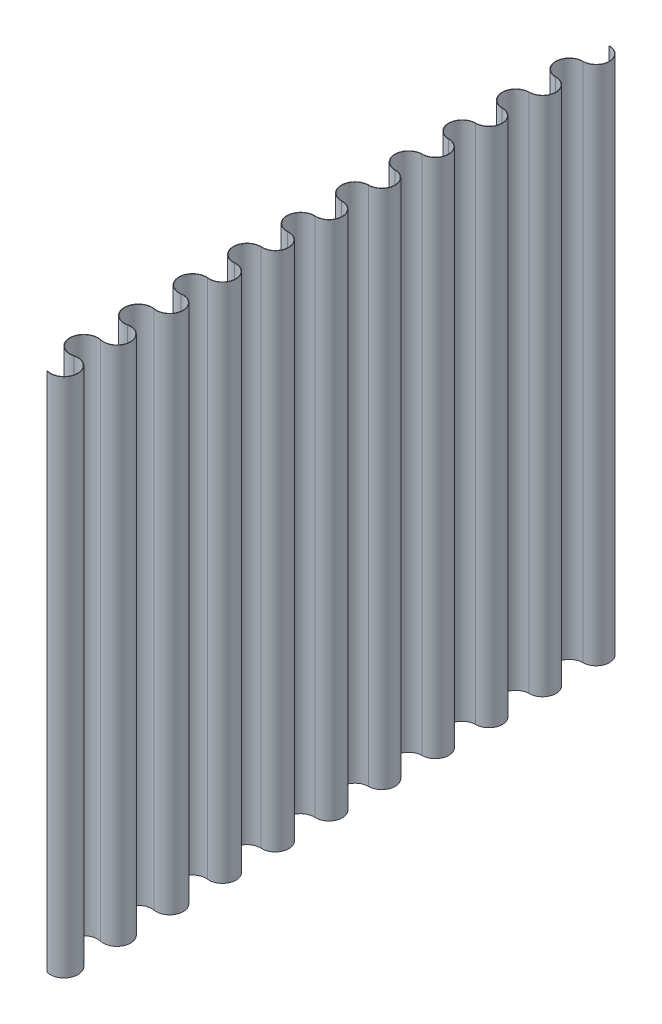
ISO-10303-21;
HEADER;
FILE_DESCRIPTION(('STEP AP214'),'2;1');
FILE_NAME('part.step','',(''),(''),'','','');
FILE_SCHEMA(('AUTOMOTIVE_DESIGN { 1 0 10303 214 1 1 1 1 }'));
ENDSEC;
DATA;
#1=APPLICATION_CONTEXT('core data for automotive mechanical design processes');
#2=APPLICATION_PROTOCOL_DEFINITION('international standard','automotive_design',2000,#1);
#3=PRODUCT_CONTEXT('',#1,'mechanical');
#4=PRODUCT('Part','Part','',(#3));
#5=PRODUCT_RELATED_PRODUCT_CATEGORY('part','',(#4));
#6=PRODUCT_DEFINITION_FORMATION('','',#4);
#7=PRODUCT_DEFINITION_CONTEXT('part definition',#1,'design');
#8=PRODUCT_DEFINITION('design','',#6,#7);
#9=PRODUCT_DEFINITION_SHAPE('','',#8);
#10=(LENGTH_UNIT() NAMED_UNIT(*) SI_UNIT(.MILLI.,.METRE.));
#11=(NAMED_UNIT(*) PLANE_ANGLE_UNIT() SI_UNIT($,.RADIAN.));
#12=(NAMED_UNIT(*) SI_UNIT($,.STERADIAN.) SOLID_ANGLE_UNIT());
#13=UNCERTAINTY_MEASURE_WITH_UNIT(LENGTH_MEASURE(1.E-05),#10,'distance_accuracy_value','');
#14=(GEOMETRIC_REPRESENTATION_CONTEXT(3) GLOBAL_UNCERTAINTY_ASSIGNED_CONTEXT((#13)) GLOBAL_UNIT_ASSIGNED_CONTEXT((#10,
#11,#12)) REPRESENTATION_CONTEXT('',''));
#15=CARTESIAN_POINT('',(0.,0.,0.));
#16=DIRECTION('',(0.,0.,1.));
#17=DIRECTION('',(1.,0.,0.));
#18=AXIS2_PLACEMENT_3D('',#15,#16,#17);
#19=CARTESIAN_POINT('',(8.88178419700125E-13,1727.2,-1787.525));
#20=DIRECTION('',(0.,-1.,0.));
#21=DIRECTION('',(0.,0.,-1.));
#22=AXIS2_PLACEMENT_3D('',#19,#20,#21);
#23=CYLINDRICAL_SURFACE('',#22,88.9);
#24=CARTESIAN_POINT('',(4.44089209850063E-13,-1727.2,-1787.525));
#25=DIRECTION('',(0.,1.,0.));
#26=DIRECTION('',(0.,0.,-1.));
#27=AXIS2_PLACEMENT_3D('',#24,#25,#26);
#28=CIRCLE('',#27,88.9);
#29=CARTESIAN_POINT('',(8.88178419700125E-13,-1727.2,-1698.625));
#30=VERTEX_POINT('',#29);
#31=CARTESIAN_POINT('',(0.,-1727.2,-1876.425));
#32=VERTEX_POINT('',#31);
#33=EDGE_CURVE('E352',#30,#32,#28,.T.);
#34=ORIENTED_EDGE('',*,*,#33,.T.);
#35=DIRECTION('',(0.,-1.,0.));
#36=VECTOR('',#35,1.);
#37=CARTESIAN_POINT('',(-4.44089209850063E-13,1727.2,-1876.425));
#38=LINE('',#37,#36);
#39=CARTESIAN_POINT('',(-4.44089209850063E-13,1727.2,-1876.425));
#40=VERTEX_POINT('',#39);
#41=EDGE_CURVE('E13',#40,#32,#38,.T.);
#42=ORIENTED_EDGE('',*,*,#41,.F.);
#43=CARTESIAN_POINT('',(8.88178419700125E-13,1727.2,-1787.525));
#44=DIRECTION('',(0.,1.,0.));
#45=DIRECTION('',(0.,0.,-1.));
#46=AXIS2_PLACEMENT_3D('',#43,#44,#45);
#47=CIRCLE('',#46,88.9);
#48=CARTESIAN_POINT('',(8.88178419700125E-13,1727.2,-1698.625));
#49=VERTEX_POINT('',#48);
#50=EDGE_CURVE('E438',#49,#40,#47,.T.);
#51=ORIENTED_EDGE('',*,*,#50,.F.);
#52=DIRECTION('',(0.,-1.,0.));
#53=VECTOR('',#52,1.);
#54=CARTESIAN_POINT('',(8.88178419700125E-13,1727.2,-1698.625));
#55=LINE('',#54,#53);
#56=EDGE_CURVE('E348',#49,#30,#55,.T.);
#57=ORIENTED_EDGE('',*,*,#56,.T.);
#58=EDGE_LOOP('',(#34,#42,#51,#57));
#59=FACE_BOUND('',#58,.T.);
#60=ADVANCED_FACE('F40',(#59),#23,.T.);
#61=CARTESIAN_POINT('',(-4.44089209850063E-13,1727.2,-1876.425));
#62=DIRECTION('',(1.,0.,0.));
#63=DIRECTION('',(0.,0.,-1.));
#64=AXIS2_PLACEMENT_3D('',#61,#62,#63);
#65=PLANE('',#64);
#66=DIRECTION('',(0.,0.,1.));
#67=VECTOR('',#66,1.);
#68=CARTESIAN_POINT('',(0.,-1727.2,-1876.425));
#69=LINE('',#68,#67);
#70=CARTESIAN_POINT('',(0.,-1727.2,-1873.88499999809));
#71=VERTEX_POINT('',#70);
#72=EDGE_CURVE('E355',#32,#71,#69,.T.);
#73=ORIENTED_EDGE('',*,*,#72,.T.);
#74=DIRECTION('',(0.,-1.,0.));
#75=VECTOR('',#74,1.);
#76=CARTESIAN_POINT('',(-8.88178419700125E-13,1727.2,-1873.88499999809));
#77=LINE('',#76,#75);
#78=CARTESIAN_POINT('',(-8.88178419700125E-13,1727.2,-1873.88499999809));
#79=VERTEX_POINT('',#78);
#80=EDGE_CURVE('E48',#79,#71,#77,.T.);
#81=ORIENTED_EDGE('',*,*,#80,.F.);
#82=DIRECTION('',(0.,0.,1.));
#83=VECTOR('',#82,1.);
#84=CARTESIAN_POINT('',(-4.44089209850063E-13,1727.2,-1876.425));
#85=LINE('',#84,#83);
#86=EDGE_CURVE('E207',#40,#79,#85,.T.);
#87=ORIENTED_EDGE('',*,*,#86,.F.);
#88=ORIENTED_EDGE('',*,*,#41,.T.);
#89=EDGE_LOOP('',(#73,#81,#87,#88));
#90=FACE_BOUND('',#89,.T.);
#91=ADVANCED_FACE('F676',(#90),#65,.F.);
#92=CARTESIAN_POINT('',(8.55759907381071E-09,1727.2,-1787.52499999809));
#93=DIRECTION('',(0.,-1.,0.));
#94=DIRECTION('',(0.,0.,-1.));
#95=AXIS2_PLACEMENT_3D('',#92,#93,#94);
#96=CYLINDRICAL_SURFACE('',#95,86.36);
#97=CARTESIAN_POINT('',(8.55804316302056E-09,-1727.2,-1787.52499999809));
#98=DIRECTION('',(0.,-1.,0.));
#99=DIRECTION('',(0.,0.,-1.));
#100=AXIS2_PLACEMENT_3D('',#97,#98,#99);
#101=CIRCLE('',#100,86.36);
#102=CARTESIAN_POINT('',(8.55848725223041E-09,-1727.2,-1701.16499999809));
#103=VERTEX_POINT('',#102);
#104=EDGE_CURVE('E357',#71,#103,#101,.T.);
#105=ORIENTED_EDGE('',*,*,#104,.T.);
#106=DIRECTION('',(0.,-1.,0.));
#107=VECTOR('',#106,1.);
#108=CARTESIAN_POINT('',(8.55848725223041E-09,1727.2,-1701.16499999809));
#109=LINE('',#108,#107);
#110=CARTESIAN_POINT('',(8.55848725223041E-09,1727.2,-1701.16499999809));
#111=VERTEX_POINT('',#110);
#112=EDGE_CURVE('E553',#111,#103,#109,.T.);
#113=ORIENTED_EDGE('',*,*,#112,.F.);
#114=CARTESIAN_POINT('',(8.55759907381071E-09,1727.2,-1787.52499999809));
#115=DIRECTION('',(0.,-1.,0.));
#116=DIRECTION('',(0.,0.,-1.));
#117=AXIS2_PLACEMENT_3D('',#114,#115,#116);
#118=CIRCLE('',#117,86.36);
#119=EDGE_CURVE('E561',#79,#111,#118,.T.);
#120=ORIENTED_EDGE('',*,*,#119,.F.);
#121=ORIENTED_EDGE('',*,*,#80,.T.);
#122=EDGE_LOOP('',(#105,#113,#120,#121));
#123=FACE_BOUND('',#122,.T.);
#124=ADVANCED_FACE('F559',(#123),#96,.F.);
#125=CARTESIAN_POINT('',(8.55981951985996E-09,1727.2,-1609.72499999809));
#126=DIRECTION('',(0.,-1.,0.));
#127=DIRECTION('',(0.,0.,-1.));
#128=AXIS2_PLACEMENT_3D('',#125,#126,#127);
#129=CYLINDRICAL_SURFACE('',#128,91.44);
#130=CARTESIAN_POINT('',(8.55981951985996E-09,-1727.2,-1609.72499999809));
#131=DIRECTION('',(0.,1.,0.));
#132=DIRECTION('',(0.,0.,1.));
#133=AXIS2_PLACEMENT_3D('',#130,#131,#132);
#134=CIRCLE('',#133,91.44);
#135=CARTESIAN_POINT('',(8.56070769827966E-09,-1727.2,-1518.28499999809));
#136=VERTEX_POINT('',#135);
#137=EDGE_CURVE('E359',#103,#136,#134,.T.);
#138=ORIENTED_EDGE('',*,*,#137,.T.);
#139=DIRECTION('',(0.,-1.,0.));
#140=VECTOR('',#139,1.);
#141=CARTESIAN_POINT('',(8.56026360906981E-09,1727.2,-1518.28499999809));
#142=LINE('',#141,#140);
#143=CARTESIAN_POINT('',(8.56026360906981E-09,1727.2,-1518.28499999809));
#144=VERTEX_POINT('',#143);
#145=EDGE_CURVE('E550',#144,#136,#142,.T.);
#146=ORIENTED_EDGE('',*,*,#145,.F.);
#147=CARTESIAN_POINT('',(8.55981951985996E-09,1727.2,-1609.72499999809));
#148=DIRECTION('',(0.,1.,0.));
#149=DIRECTION('',(0.,0.,1.));
#150=AXIS2_PLACEMENT_3D('',#147,#148,#149);
#151=CIRCLE('',#150,91.44);
#152=EDGE_CURVE('E579',#111,#144,#151,.T.);
#153=ORIENTED_EDGE('',*,*,#152,.F.);
#154=ORIENTED_EDGE('',*,*,#112,.T.);
#155=EDGE_LOOP('',(#138,#146,#153,#154));
#156=FACE_BOUND('',#155,.T.);
#157=ADVANCED_FACE('F570',(#156),#129,.T.);
#158=CARTESIAN_POINT('',(8.56203996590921E-09,1727.2,-1431.92499999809));
#159=DIRECTION('',(0.,-1.,0.));
#160=DIRECTION('',(0.,0.,-1.));
#161=AXIS2_PLACEMENT_3D('',#158,#159,#160);
#162=CYLINDRICAL_SURFACE('',#161,86.36);
#163=CARTESIAN_POINT('',(8.56203996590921E-09,-1727.2,-1431.92499999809));
#164=DIRECTION('',(0.,-1.,0.));
#165=DIRECTION('',(0.,0.,-1.));
#166=AXIS2_PLACEMENT_3D('',#163,#164,#165);
#167=CIRCLE('',#166,86.36);
#168=CARTESIAN_POINT('',(8.56248405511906E-09,-1727.2,-1345.56499999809));
#169=VERTEX_POINT('',#168);
#170=EDGE_CURVE('E361',#136,#169,#167,.T.);
#171=ORIENTED_EDGE('',*,*,#170,.T.);
#172=DIRECTION('',(0.,-1.,0.));
#173=VECTOR('',#172,1.);
#174=CARTESIAN_POINT('',(8.56292814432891E-09,1727.2,-1345.56499999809));
#175=LINE('',#174,#173);
#176=CARTESIAN_POINT('',(8.56292814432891E-09,1727.2,-1345.56499999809));
#177=VERTEX_POINT('',#176);
#178=EDGE_CURVE('E547',#177,#169,#175,.T.);
#179=ORIENTED_EDGE('',*,*,#178,.F.);
#180=CARTESIAN_POINT('',(8.56203996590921E-09,1727.2,-1431.92499999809));
#181=DIRECTION('',(0.,-1.,0.));
#182=DIRECTION('',(0.,0.,-1.));
#183=AXIS2_PLACEMENT_3D('',#180,#181,#182);
#184=CIRCLE('',#183,86.36);
#185=EDGE_CURVE('E576',#144,#177,#184,.T.);
#186=ORIENTED_EDGE('',*,*,#185,.F.);
#187=ORIENTED_EDGE('',*,*,#145,.T.);
#188=EDGE_LOOP('',(#171,#179,#186,#187));
#189=FACE_BOUND('',#188,.T.);
#190=ADVANCED_FACE('F574',(#189),#162,.F.);
#191=CARTESIAN_POINT('',(8.56337223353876E-09,1727.2,-1254.12499999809));
#192=DIRECTION('',(0.,-1.,0.));
#193=DIRECTION('',(0.,0.,-1.));
#194=AXIS2_PLACEMENT_3D('',#191,#192,#193);
#195=CYLINDRICAL_SURFACE('',#194,91.4400000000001);
#196=CARTESIAN_POINT('',(8.56381632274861E-09,-1727.2,-1254.12499999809));
#197=DIRECTION('',(0.,1.,0.));
#198=DIRECTION('',(0.,0.,1.));
#199=AXIS2_PLACEMENT_3D('',#196,#197,#198);
#200=CIRCLE('',#199,91.4400000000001);
#201=CARTESIAN_POINT('',(8.56381632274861E-09,-1727.2,-1162.68499999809));
#202=VERTEX_POINT('',#201);
#203=EDGE_CURVE('E363',#169,#202,#200,.T.);
#204=ORIENTED_EDGE('',*,*,#203,.T.);
#205=DIRECTION('',(0.,-1.,0.));
#206=VECTOR('',#205,1.);
#207=CARTESIAN_POINT('',(8.56381632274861E-09,1727.2,-1162.68499999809));
#208=LINE('',#207,#206);
#209=CARTESIAN_POINT('',(8.56381632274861E-09,1727.2,-1162.68499999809));
#210=VERTEX_POINT('',#209);
#211=EDGE_CURVE('E544',#210,#202,#208,.T.);
#212=ORIENTED_EDGE('',*,*,#211,.F.);
#213=CARTESIAN_POINT('',(8.56337223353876E-09,1727.2,-1254.12499999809));
#214=DIRECTION('',(0.,1.,0.));
#215=DIRECTION('',(0.,0.,1.));
#216=AXIS2_PLACEMENT_3D('',#213,#214,#215);
#217=CIRCLE('',#216,91.4400000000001);
#218=EDGE_CURVE('E578',#177,#210,#217,.T.);
#219=ORIENTED_EDGE('',*,*,#218,.F.);
#220=ORIENTED_EDGE('',*,*,#178,.T.);
#221=EDGE_LOOP('',(#204,#212,#219,#220));
#222=FACE_BOUND('',#221,.T.);
#223=ADVANCED_FACE('F689',(#222),#195,.T.);
#224=CARTESIAN_POINT('',(8.56470450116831E-09,1727.2,-1076.32499999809));
#225=DIRECTION('',(0.,-1.,0.));
#226=DIRECTION('',(0.,0.,-1.));
#227=AXIS2_PLACEMENT_3D('',#224,#225,#226);
#228=CYLINDRICAL_SURFACE('',#227,86.3599999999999);
#229=CARTESIAN_POINT('',(8.56559267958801E-09,-1727.2,-1076.32499999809));
#230=DIRECTION('',(0.,-1.,0.));
#231=DIRECTION('',(0.,0.,-1.));
#232=AXIS2_PLACEMENT_3D('',#229,#230,#231);
#233=CIRCLE('',#232,86.3599999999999);
#234=CARTESIAN_POINT('',(8.56648085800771E-09,-1727.2,-989.964999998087));
#235=VERTEX_POINT('',#234);
#236=EDGE_CURVE('E365',#202,#235,#233,.T.);
#237=ORIENTED_EDGE('',*,*,#236,.T.);
#238=DIRECTION('',(0.,-1.,0.));
#239=VECTOR('',#238,1.);
#240=CARTESIAN_POINT('',(8.56648085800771E-09,1727.2,-989.964999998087));
#241=LINE('',#240,#239);
#242=CARTESIAN_POINT('',(8.56648085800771E-09,1727.2,-989.964999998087));
#243=VERTEX_POINT('',#242);
#244=EDGE_CURVE('E541',#243,#235,#241,.T.);
#245=ORIENTED_EDGE('',*,*,#244,.F.);
#246=CARTESIAN_POINT('',(8.56470450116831E-09,1727.2,-1076.32499999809));
#247=DIRECTION('',(0.,-1.,0.));
#248=DIRECTION('',(0.,0.,-1.));
#249=AXIS2_PLACEMENT_3D('',#246,#247,#248);
#250=CIRCLE('',#249,86.3599999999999);
#251=EDGE_CURVE('E581',#210,#243,#250,.T.);
#252=ORIENTED_EDGE('',*,*,#251,.F.);
#253=ORIENTED_EDGE('',*,*,#211,.T.);
#254=EDGE_LOOP('',(#237,#245,#252,#253));
#255=FACE_BOUND('',#254,.T.);
#256=ADVANCED_FACE('F692',(#255),#228,.F.);
#257=CARTESIAN_POINT('',(8.56736903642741E-09,1727.2,-898.524999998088));
#258=DIRECTION('',(0.,-1.,0.));
#259=DIRECTION('',(0.,0.,-1.));
#260=AXIS2_PLACEMENT_3D('',#257,#258,#259);
#261=CYLINDRICAL_SURFACE('',#260,91.4400000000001);
#262=CARTESIAN_POINT('',(8.56736903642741E-09,-1727.2,-898.524999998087));
#263=DIRECTION('',(0.,1.,0.));
#264=DIRECTION('',(0.,0.,1.));
#265=AXIS2_PLACEMENT_3D('',#262,#263,#264);
#266=CIRCLE('',#265,91.4400000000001);
#267=CARTESIAN_POINT('',(8.56870130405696E-09,-1727.2,-807.084999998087));
#268=VERTEX_POINT('',#267);
#269=EDGE_CURVE('E367',#235,#268,#266,.T.);
#270=ORIENTED_EDGE('',*,*,#269,.T.);
#271=DIRECTION('',(0.,-1.,0.));
#272=VECTOR('',#271,1.);
#273=CARTESIAN_POINT('',(8.56825721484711E-09,1727.2,-807.084999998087));
#274=LINE('',#273,#272);
#275=CARTESIAN_POINT('',(8.56825721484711E-09,1727.2,-807.084999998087));
#276=VERTEX_POINT('',#275);
#277=EDGE_CURVE('E538',#276,#268,#274,.T.);
#278=ORIENTED_EDGE('',*,*,#277,.F.);
#279=CARTESIAN_POINT('',(8.56736903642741E-09,1727.2,-898.524999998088));
#280=DIRECTION('',(0.,1.,0.));
#281=DIRECTION('',(0.,0.,1.));
#282=AXIS2_PLACEMENT_3D('',#279,#280,#281);
#283=CIRCLE('',#282,91.4400000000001);
#284=EDGE_CURVE('E587',#243,#276,#283,.T.);
#285=ORIENTED_EDGE('',*,*,#284,.F.);
#286=ORIENTED_EDGE('',*,*,#244,.T.);
#287=EDGE_LOOP('',(#270,#278,#285,#286));
#288=FACE_BOUND('',#287,.T.);
#289=ADVANCED_FACE('F696',(#288),#261,.T.);
#290=CARTESIAN_POINT('',(8.56914539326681E-09,1727.2,-720.724999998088));
#291=DIRECTION('',(0.,-1.,0.));
#292=DIRECTION('',(0.,0.,-1.));
#293=AXIS2_PLACEMENT_3D('',#290,#291,#292);
#294=CYLINDRICAL_SURFACE('',#293,86.3599999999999);
#295=CARTESIAN_POINT('',(8.56914539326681E-09,-1727.2,-720.724999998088));
#296=DIRECTION('',(0.,-1.,0.));
#297=DIRECTION('',(0.,0.,-1.));
#298=AXIS2_PLACEMENT_3D('',#295,#296,#297);
#299=CIRCLE('',#298,86.3599999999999);
#300=CARTESIAN_POINT('',(8.57047766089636E-09,-1727.2,-634.364999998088));
#301=VERTEX_POINT('',#300);
#302=EDGE_CURVE('E369',#268,#301,#299,.T.);
#303=ORIENTED_EDGE('',*,*,#302,.T.);
#304=DIRECTION('',(0.,-1.,0.));
#305=VECTOR('',#304,1.);
#306=CARTESIAN_POINT('',(8.57092175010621E-09,1727.2,-634.364999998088));
#307=LINE('',#306,#305);
#308=CARTESIAN_POINT('',(8.57092175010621E-09,1727.2,-634.364999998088));
#309=VERTEX_POINT('',#308);
#310=EDGE_CURVE('E535',#309,#301,#307,.T.);
#311=ORIENTED_EDGE('',*,*,#310,.F.);
#312=CARTESIAN_POINT('',(8.56914539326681E-09,1727.2,-720.724999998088));
#313=DIRECTION('',(0.,-1.,0.));
#314=DIRECTION('',(0.,0.,-1.));
#315=AXIS2_PLACEMENT_3D('',#312,#313,#314);
#316=CIRCLE('',#315,86.3599999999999);
#317=EDGE_CURVE('E589',#276,#309,#316,.T.);
#318=ORIENTED_EDGE('',*,*,#317,.F.);
#319=ORIENTED_EDGE('',*,*,#277,.T.);
#320=EDGE_LOOP('',(#303,#311,#318,#319));
#321=FACE_BOUND('',#320,.T.);
#322=ADVANCED_FACE('F700',(#321),#294,.F.);
#323=CARTESIAN_POINT('',(8.57136583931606E-09,1727.2,-542.924999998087));
#324=DIRECTION('',(0.,-1.,0.));
#325=DIRECTION('',(0.,0.,-1.));
#326=AXIS2_PLACEMENT_3D('',#323,#324,#325);
#327=CYLINDRICAL_SURFACE('',#326,91.44);
#328=CARTESIAN_POINT('',(8.57136583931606E-09,-1727.2,-542.924999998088));
#329=DIRECTION('',(0.,1.,0.));
#330=DIRECTION('',(0.,0.,1.));
#331=AXIS2_PLACEMENT_3D('',#328,#329,#330);
#332=CIRCLE('',#331,91.44);
#333=CARTESIAN_POINT('',(8.57225401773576E-09,-1727.2,-451.484999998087));
#334=VERTEX_POINT('',#333);
#335=EDGE_CURVE('E371',#301,#334,#332,.T.);
#336=ORIENTED_EDGE('',*,*,#335,.T.);
#337=DIRECTION('',(0.,-1.,0.));
#338=VECTOR('',#337,1.);
#339=CARTESIAN_POINT('',(8.57180992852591E-09,1727.2,-451.484999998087));
#340=LINE('',#339,#338);
#341=CARTESIAN_POINT('',(8.57180992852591E-09,1727.2,-451.484999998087));
#342=VERTEX_POINT('',#341);
#343=EDGE_CURVE('E532',#342,#334,#340,.T.);
#344=ORIENTED_EDGE('',*,*,#343,.F.);
#345=CARTESIAN_POINT('',(8.57136583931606E-09,1727.2,-542.924999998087));
#346=DIRECTION('',(0.,1.,0.));
#347=DIRECTION('',(0.,0.,1.));
#348=AXIS2_PLACEMENT_3D('',#345,#346,#347);
#349=CIRCLE('',#348,91.44);
#350=EDGE_CURVE('E591',#309,#342,#349,.T.);
#351=ORIENTED_EDGE('',*,*,#350,.F.);
#352=ORIENTED_EDGE('',*,*,#310,.T.);
#353=EDGE_LOOP('',(#336,#344,#351,#352));
#354=FACE_BOUND('',#353,.T.);
#355=ADVANCED_FACE('F704',(#354),#327,.T.);
#356=CARTESIAN_POINT('',(8.57225401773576E-09,1727.2,-365.124999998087));
#357=DIRECTION('',(0.,-1.,0.));
#358=DIRECTION('',(0.,0.,-1.));
#359=AXIS2_PLACEMENT_3D('',#356,#357,#358);
#360=CYLINDRICAL_SURFACE('',#359,86.36);
#361=CARTESIAN_POINT('',(8.57314219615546E-09,-1727.2,-365.124999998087));
#362=DIRECTION('',(0.,-1.,0.));
#363=DIRECTION('',(0.,0.,-1.));
#364=AXIS2_PLACEMENT_3D('',#361,#362,#363);
#365=CIRCLE('',#364,86.36);
#366=CARTESIAN_POINT('',(8.57403037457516E-09,-1727.2,-278.764999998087));
#367=VERTEX_POINT('',#366);
#368=EDGE_CURVE('E373',#334,#367,#365,.T.);
#369=ORIENTED_EDGE('',*,*,#368,.T.);
#370=DIRECTION('',(0.,-1.,0.));
#371=VECTOR('',#370,1.);
#372=CARTESIAN_POINT('',(8.57314219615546E-09,1727.2,-278.764999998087));
#373=LINE('',#372,#371);
#374=CARTESIAN_POINT('',(8.57314219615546E-09,1727.2,-278.764999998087));
#375=VERTEX_POINT('',#374);
#376=EDGE_CURVE('E529',#375,#367,#373,.T.);
#377=ORIENTED_EDGE('',*,*,#376,.F.);
#378=CARTESIAN_POINT('',(8.57225401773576E-09,1727.2,-365.124999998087));
#379=DIRECTION('',(0.,-1.,0.));
#380=DIRECTION('',(0.,0.,-1.));
#381=AXIS2_PLACEMENT_3D('',#378,#379,#380);
#382=CIRCLE('',#381,86.36);
#383=EDGE_CURVE('E593',#342,#375,#382,.T.);
#384=ORIENTED_EDGE('',*,*,#383,.F.);
#385=ORIENTED_EDGE('',*,*,#343,.T.);
#386=EDGE_LOOP('',(#369,#377,#384,#385));
#387=FACE_BOUND('',#386,.T.);
#388=ADVANCED_FACE('F708',(#387),#360,.F.);
#389=CARTESIAN_POINT('',(8.57491855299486E-09,1727.2,-187.306857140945));
#390=DIRECTION('',(0.,-1.,0.));
#391=DIRECTION('',(0.,0.,-1.));
#392=AXIS2_PLACEMENT_3D('',#389,#390,#391);
#393=CYLINDRICAL_SURFACE('',#392,91.4581428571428);
#394=CARTESIAN_POINT('',(8.57491855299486E-09,-1727.2,-187.306857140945));
#395=DIRECTION('',(0.,1.,0.));
#396=DIRECTION('',(0.,0.,1.));
#397=AXIS2_PLACEMENT_3D('',#394,#395,#396);
#398=CIRCLE('',#397,91.4581428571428);
#399=CARTESIAN_POINT('',(2.61255662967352,-1727.2,-95.8860365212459));
#400=VERTEX_POINT('',#399);
#401=EDGE_CURVE('E375',#367,#400,#398,.T.);
#402=ORIENTED_EDGE('',*,*,#401,.T.);
#403=DIRECTION('',(0.,-1.,0.));
#404=VECTOR('',#403,1.);
#405=CARTESIAN_POINT('',(2.61255662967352,1727.2,-95.8860365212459));
#406=LINE('',#405,#404);
#407=CARTESIAN_POINT('',(2.61255662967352,1727.2,-95.8860365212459));
#408=VERTEX_POINT('',#407);
#409=EDGE_CURVE('E526',#408,#400,#406,.T.);
#410=ORIENTED_EDGE('',*,*,#409,.F.);
#411=CARTESIAN_POINT('',(8.57491855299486E-09,1727.2,-187.306857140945));
#412=DIRECTION('',(0.,1.,0.));
#413=DIRECTION('',(0.,0.,1.));
#414=AXIS2_PLACEMENT_3D('',#411,#412,#413);
#415=CIRCLE('',#414,91.4581428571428);
#416=EDGE_CURVE('E595',#375,#408,#415,.T.);
#417=ORIENTED_EDGE('',*,*,#416,.F.);
#418=ORIENTED_EDGE('',*,*,#376,.T.);
#419=EDGE_LOOP('',(#402,#410,#417,#418));
#420=FACE_BOUND('',#419,.T.);
#421=ADVANCED_FACE('F712',(#420),#393,.T.);
#422=CARTESIAN_POINT('',(5.08207474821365,1727.2,-9.4705417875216));
#423=DIRECTION('',(0.,-1.,0.));
#424=DIRECTION('',(0.,0.,-1.));
#425=AXIS2_PLACEMENT_3D('',#422,#423,#424);
#426=CYLINDRICAL_SURFACE('',#425,86.4507735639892);
#427=CARTESIAN_POINT('',(5.08207474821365,-1727.2,-9.47054178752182));
#428=DIRECTION('',(0.,-1.,0.));
#429=DIRECTION('',(0.,0.,-1.));
#430=AXIS2_PLACEMENT_3D('',#427,#428,#429);
#431=CIRCLE('',#430,86.4507735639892);
#432=CARTESIAN_POINT('',(0.145054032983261,-1727.2,76.8391452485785));
#433=VERTEX_POINT('',#432);
#434=EDGE_CURVE('E377',#400,#433,#431,.T.);
#435=ORIENTED_EDGE('',*,*,#434,.T.);
#436=DIRECTION('',(0.,-1.,0.));
#437=VECTOR('',#436,1.);
#438=CARTESIAN_POINT('',(0.145054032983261,1727.2,76.8391452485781));
#439=LINE('',#438,#437);
#440=CARTESIAN_POINT('',(0.145054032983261,1727.2,76.8391452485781));
#441=VERTEX_POINT('',#440);
#442=EDGE_CURVE('E523',#441,#433,#439,.T.);
#443=ORIENTED_EDGE('',*,*,#442,.F.);
#444=CARTESIAN_POINT('',(5.08207474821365,1727.2,-9.4705417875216));
#445=DIRECTION('',(0.,-1.,0.));
#446=DIRECTION('',(0.,0.,-1.));
#447=AXIS2_PLACEMENT_3D('',#444,#445,#446);
#448=CIRCLE('',#447,86.4507735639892);
#449=EDGE_CURVE('E597',#408,#441,#448,.T.);
#450=ORIENTED_EDGE('',*,*,#449,.F.);
#451=ORIENTED_EDGE('',*,*,#409,.T.);
#452=EDGE_LOOP('',(#435,#443,#450,#451));
#453=FACE_BOUND('',#452,.T.);
#454=ADVANCED_FACE('F716',(#453),#426,.F.);
#455=CARTESIAN_POINT('',(-5.08518980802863,1727.2,168.275000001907));
#456=DIRECTION('',(0.,-1.,0.));
#457=DIRECTION('',(0.,0.,-1.));
#458=AXIS2_PLACEMENT_3D('',#455,#456,#457);
#459=CYLINDRICAL_SURFACE('',#458,91.5853207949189);
#460=CARTESIAN_POINT('',(-5.08518980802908,-1727.2,168.275000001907));
#461=DIRECTION('',(0.,1.,0.));
#462=DIRECTION('',(0.,0.,1.));
#463=AXIS2_PLACEMENT_3D('',#460,#461,#462);
#464=CIRCLE('',#463,91.5853207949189);
#465=CARTESIAN_POINT('',(0.145054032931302,-1727.2,259.710854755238));
#466=VERTEX_POINT('',#465);
#467=EDGE_CURVE('E379',#433,#466,#464,.T.);
#468=ORIENTED_EDGE('',*,*,#467,.T.);
#469=DIRECTION('',(0.,-1.,0.));
#470=VECTOR('',#469,1.);
#471=CARTESIAN_POINT('',(0.145054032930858,1727.2,259.710854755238));
#472=LINE('',#471,#470);
#473=CARTESIAN_POINT('',(0.145054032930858,1727.2,259.710854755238));
#474=VERTEX_POINT('',#473);
#475=EDGE_CURVE('E520',#474,#466,#472,.T.);
#476=ORIENTED_EDGE('',*,*,#475,.F.);
#477=CARTESIAN_POINT('',(-5.08518980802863,1727.2,168.275000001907));
#478=DIRECTION('',(0.,1.,0.));
#479=DIRECTION('',(0.,0.,1.));
#480=AXIS2_PLACEMENT_3D('',#477,#478,#479);
#481=CIRCLE('',#480,91.5853207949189);
#482=EDGE_CURVE('E599',#441,#474,#481,.T.);
#483=ORIENTED_EDGE('',*,*,#482,.F.);
#484=ORIENTED_EDGE('',*,*,#442,.T.);
#485=EDGE_LOOP('',(#468,#476,#483,#484));
#486=FACE_BOUND('',#485,.T.);
#487=ADVANCED_FACE('F720',(#486),#459,.T.);
#488=CARTESIAN_POINT('',(5.08518982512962,1727.2,346.075000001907));
#489=DIRECTION('',(0.,-1.,0.));
#490=DIRECTION('',(0.,0.,-1.));
#491=AXIS2_PLACEMENT_3D('',#488,#489,#490);
#492=CYLINDRICAL_SURFACE('',#491,86.5053207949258);
#493=CARTESIAN_POINT('',(5.08518982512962,-1727.2,346.075000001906));
#494=DIRECTION('',(0.,-1.,0.));
#495=DIRECTION('',(0.,0.,-1.));
#496=AXIS2_PLACEMENT_3D('',#493,#494,#495);
#497=CIRCLE('',#496,86.5053207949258);
#498=CARTESIAN_POINT('',(0.145054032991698,-1727.2,432.439145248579));
#499=VERTEX_POINT('',#498);
#500=EDGE_CURVE('E381',#466,#499,#497,.T.);
#501=ORIENTED_EDGE('',*,*,#500,.T.);
#502=DIRECTION('',(0.,-1.,0.));
#503=VECTOR('',#502,1.);
#504=CARTESIAN_POINT('',(0.145054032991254,1727.2,432.439145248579));
#505=LINE('',#504,#503);
#506=CARTESIAN_POINT('',(0.145054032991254,1727.2,432.439145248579));
#507=VERTEX_POINT('',#506);
#508=EDGE_CURVE('E517',#507,#499,#505,.T.);
#509=ORIENTED_EDGE('',*,*,#508,.F.);
#510=CARTESIAN_POINT('',(5.08518982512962,1727.2,346.075000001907));
#511=DIRECTION('',(0.,-1.,0.));
#512=DIRECTION('',(0.,0.,-1.));
#513=AXIS2_PLACEMENT_3D('',#510,#511,#512);
#514=CIRCLE('',#513,86.5053207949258);
#515=EDGE_CURVE('E601',#474,#507,#514,.T.);
#516=ORIENTED_EDGE('',*,*,#515,.F.);
#517=ORIENTED_EDGE('',*,*,#475,.T.);
#518=EDGE_LOOP('',(#501,#509,#516,#517));
#519=FACE_BOUND('',#518,.T.);
#520=ADVANCED_FACE('F724',(#519),#492,.F.);
#521=CARTESIAN_POINT('',(-5.09038726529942,1727.2,523.965862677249));
#522=DIRECTION('',(0.,-1.,0.));
#523=DIRECTION('',(0.,0.,-1.));
#524=AXIS2_PLACEMENT_3D('',#521,#522,#523);
#525=CYLINDRICAL_SURFACE('',#524,91.6763319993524);
#526=CARTESIAN_POINT('',(-5.09038726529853,-1727.2,523.965862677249));
#527=DIRECTION('',(0.,1.,0.));
#528=DIRECTION('',(0.,0.,1.));
#529=AXIS2_PLACEMENT_3D('',#526,#527,#528);
#530=CIRCLE('',#529,91.6763319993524);
#531=CARTESIAN_POINT('',(2.75743304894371,-1727.2,615.3056763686));
#532=VERTEX_POINT('',#531);
#533=EDGE_CURVE('E383',#499,#532,#530,.T.);
#534=ORIENTED_EDGE('',*,*,#533,.T.);
#535=DIRECTION('',(0.,-1.,0.));
#536=VECTOR('',#535,1.);
#537=CARTESIAN_POINT('',(2.7574330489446,1727.2,615.305676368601));
#538=LINE('',#537,#536);
#539=CARTESIAN_POINT('',(2.7574330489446,1727.2,615.305676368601));
#540=VERTEX_POINT('',#539);
#541=EDGE_CURVE('E514',#540,#532,#538,.T.);
#542=ORIENTED_EDGE('',*,*,#541,.F.);
#543=CARTESIAN_POINT('',(-5.09038726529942,1727.2,523.965862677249));
#544=DIRECTION('',(0.,1.,0.));
#545=DIRECTION('',(0.,0.,1.));
#546=AXIS2_PLACEMENT_3D('',#543,#544,#545);
#547=CIRCLE('',#546,91.6763319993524);
#548=EDGE_CURVE('E603',#507,#540,#547,.T.);
#549=ORIENTED_EDGE('',*,*,#548,.F.);
#550=ORIENTED_EDGE('',*,*,#508,.T.);
#551=EDGE_LOOP('',(#534,#542,#549,#550));
#552=FACE_BOUND('',#551,.T.);
#553=ADVANCED_FACE('F728',(#552),#525,.T.);
#554=CARTESIAN_POINT('',(10.1891415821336,1727.2,701.8024163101));
#555=DIRECTION('',(0.,-1.,0.));
#556=DIRECTION('',(0.,0.,-1.));
#557=AXIS2_PLACEMENT_3D('',#554,#555,#556);
#558=CYLINDRICAL_SURFACE('',#557,86.8154151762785);
#559=CARTESIAN_POINT('',(10.1891415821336,-1727.2,701.8024163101));
#560=DIRECTION('',(0.,-1.,0.));
#561=DIRECTION('',(0.,0.,-1.));
#562=AXIS2_PLACEMENT_3D('',#559,#560,#561);
#563=CIRCLE('',#562,86.8154151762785);
#564=CARTESIAN_POINT('',(0.289634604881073,-1727.2,788.051567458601));
#565=VERTEX_POINT('',#564);
#566=EDGE_CURVE('E385',#532,#565,#563,.T.);
#567=ORIENTED_EDGE('',*,*,#566,.T.);
#568=DIRECTION('',(0.,-1.,0.));
#569=VECTOR('',#568,1.);
#570=CARTESIAN_POINT('',(0.289634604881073,1727.2,788.051567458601));
#571=LINE('',#570,#569);
#572=CARTESIAN_POINT('',(0.289634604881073,1727.2,788.051567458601));
#573=VERTEX_POINT('',#572);
#574=EDGE_CURVE('E511',#573,#565,#571,.T.);
#575=ORIENTED_EDGE('',*,*,#574,.F.);
#576=CARTESIAN_POINT('',(10.1891415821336,1727.2,701.8024163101));
#577=DIRECTION('',(0.,-1.,0.));
#578=DIRECTION('',(0.,0.,-1.));
#579=AXIS2_PLACEMENT_3D('',#576,#577,#578);
#580=CIRCLE('',#579,86.8154151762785);
#581=EDGE_CURVE('E605',#540,#573,#580,.T.);
#582=ORIENTED_EDGE('',*,*,#581,.F.);
#583=ORIENTED_EDGE('',*,*,#541,.T.);
#584=EDGE_LOOP('',(#567,#575,#582,#583));
#585=FACE_BOUND('',#584,.T.);
#586=ADVANCED_FACE('F732',(#585),#558,.F.);
#587=CARTESIAN_POINT('',(-10.2226104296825,1727.2,879.639180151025));
#588=DIRECTION('',(0.,-1.,0.));
#589=DIRECTION('',(0.,0.,-1.));
#590=AXIS2_PLACEMENT_3D('',#587,#588,#589);
#591=CYLINDRICAL_SURFACE('',#590,92.1889260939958);
#592=CARTESIAN_POINT('',(-10.2226104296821,-1727.2,879.639180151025));
#593=DIRECTION('',(0.,1.,0.));
#594=DIRECTION('',(0.,0.,1.));
#595=AXIS2_PLACEMENT_3D('',#592,#593,#594);
#596=CIRCLE('',#595,92.1889260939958);
#597=CARTESIAN_POINT('',(2.90159977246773,-1727.2,970.889129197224));
#598=VERTEX_POINT('',#597);
#599=EDGE_CURVE('E387',#565,#598,#596,.T.);
#600=ORIENTED_EDGE('',*,*,#599,.T.);
#601=DIRECTION('',(0.,-1.,0.));
#602=VECTOR('',#601,1.);
#603=CARTESIAN_POINT('',(2.90159977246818,1727.2,970.889129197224));
#604=LINE('',#603,#602);
#605=CARTESIAN_POINT('',(2.90159977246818,1727.2,970.889129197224));
#606=VERTEX_POINT('',#605);
#607=EDGE_CURVE('E508',#606,#598,#604,.T.);
#608=ORIENTED_EDGE('',*,*,#607,.F.);
#609=CARTESIAN_POINT('',(-10.2226104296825,1727.2,879.639180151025));
#610=DIRECTION('',(0.,1.,0.));
#611=DIRECTION('',(0.,0.,1.));
#612=AXIS2_PLACEMENT_3D('',#609,#610,#611);
#613=CIRCLE('',#612,92.1889260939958);
#614=EDGE_CURVE('E607',#573,#606,#613,.T.);
#615=ORIENTED_EDGE('',*,*,#614,.F.);
#616=ORIENTED_EDGE('',*,*,#574,.T.);
#617=EDGE_LOOP('',(#600,#608,#615,#616));
#618=FACE_BOUND('',#617,.T.);
#619=ADVANCED_FACE('F736',(#618),#591,.T.);
#620=CARTESIAN_POINT('',(15.3551643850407,1727.2,1057.47621663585));
#621=DIRECTION('',(0.,-1.,0.));
#622=DIRECTION('',(0.,0.,-1.));
#623=AXIS2_PLACEMENT_3D('',#620,#621,#622);
#624=CYLINDRICAL_SURFACE('',#623,87.4780828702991);
#625=CARTESIAN_POINT('',(15.3551643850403,-1727.2,1057.47621663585));
#626=DIRECTION('',(0.,-1.,0.));
#627=DIRECTION('',(0.,0.,-1.));
#628=AXIS2_PLACEMENT_3D('',#625,#626,#627);
#629=CIRCLE('',#628,87.4780828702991);
#630=CARTESIAN_POINT('',(0.433269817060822,-1727.2,1143.6722260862));
#631=VERTEX_POINT('',#630);
#632=EDGE_CURVE('E389',#598,#631,#629,.T.);
#633=ORIENTED_EDGE('',*,*,#632,.T.);
#634=DIRECTION('',(0.,-1.,0.));
#635=VECTOR('',#634,1.);
#636=CARTESIAN_POINT('',(0.433269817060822,1727.2,1143.6722260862));
#637=LINE('',#636,#635);
#638=CARTESIAN_POINT('',(0.433269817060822,1727.2,1143.6722260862));
#639=VERTEX_POINT('',#638);
#640=EDGE_CURVE('E505',#639,#631,#637,.T.);
#641=ORIENTED_EDGE('',*,*,#640,.F.);
#642=CARTESIAN_POINT('',(15.3551643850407,1727.2,1057.47621663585));
#643=DIRECTION('',(0.,-1.,0.));
#644=DIRECTION('',(0.,0.,-1.));
#645=AXIS2_PLACEMENT_3D('',#642,#643,#644);
#646=CIRCLE('',#645,87.4780828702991);
#647=EDGE_CURVE('E609',#606,#639,#646,.T.);
#648=ORIENTED_EDGE('',*,*,#647,.F.);
#649=ORIENTED_EDGE('',*,*,#607,.T.);
#650=EDGE_LOOP('',(#633,#641,#648,#649));
#651=FACE_BOUND('',#650,.T.);
#652=ADVANCED_FACE('F740',(#651),#624,.F.);
#653=CARTESIAN_POINT('',(-15.431301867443,1727.2,1235.31359002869));
#654=DIRECTION('',(0.,-1.,0.));
#655=DIRECTION('',(0.,0.,-1.));
#656=AXIS2_PLACEMENT_3D('',#653,#654,#655);
#657=CYLINDRICAL_SURFACE('',#656,93.0044311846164);
#658=CARTESIAN_POINT('',(-15.4313018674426,-1727.2,1235.31359002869));
#659=DIRECTION('',(0.,1.,0.));
#660=DIRECTION('',(0.,0.,1.));
#661=AXIS2_PLACEMENT_3D('',#658,#659,#660);
#662=CIRCLE('',#661,93.0044311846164);
#663=CARTESIAN_POINT('',(3.04458624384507,-1727.2,1326.46437597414));
#664=VERTEX_POINT('',#663);
#665=EDGE_CURVE('E391',#631,#664,#662,.T.);
#666=ORIENTED_EDGE('',*,*,#665,.T.);
#667=DIRECTION('',(0.,-1.,0.));
#668=VECTOR('',#667,1.);
#669=CARTESIAN_POINT('',(3.04458624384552,1727.2,1326.46437597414));
#670=LINE('',#669,#668);
#671=CARTESIAN_POINT('',(3.04458624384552,1727.2,1326.46437597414));
#672=VERTEX_POINT('',#671);
#673=EDGE_CURVE('E502',#672,#664,#670,.T.);
#674=ORIENTED_EDGE('',*,*,#673,.F.);
#675=CARTESIAN_POINT('',(-15.431301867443,1727.2,1235.31359002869));
#676=DIRECTION('',(0.,1.,0.));
#677=DIRECTION('',(0.,0.,1.));
#678=AXIS2_PLACEMENT_3D('',#675,#676,#677);
#679=CIRCLE('',#678,93.0044311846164);
#680=EDGE_CURVE('E611',#639,#672,#679,.T.);
#681=ORIENTED_EDGE('',*,*,#680,.F.);
#682=ORIENTED_EDGE('',*,*,#640,.T.);
#683=EDGE_LOOP('',(#666,#674,#681,#682));
#684=FACE_BOUND('',#683,.T.);
#685=ADVANCED_FACE('F744',(#684),#657,.T.);
#686=CARTESIAN_POINT('',(20.6156815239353,1727.2,1413.15136688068));
#687=DIRECTION('',(0.,-1.,0.));
#688=DIRECTION('',(0.,0.,-1.));
#689=AXIS2_PLACEMENT_3D('',#686,#687,#688);
#690=CYLINDRICAL_SURFACE('',#689,88.4498602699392);
#691=CARTESIAN_POINT('',(20.6156815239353,-1727.2,1413.15136688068));
#692=DIRECTION('',(0.,-1.,0.));
#693=DIRECTION('',(0.,0.,-1.));
#694=AXIS2_PLACEMENT_3D('',#691,#692,#693);
#695=CIRCLE('',#694,88.4498602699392);
#696=CARTESIAN_POINT('',(0.575490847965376,-1727.2,1499.30105370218));
#697=VERTEX_POINT('',#696);
#698=EDGE_CURVE('E393',#664,#697,#695,.T.);
#699=ORIENTED_EDGE('',*,*,#698,.T.);
#700=DIRECTION('',(0.,-1.,0.));
#701=VECTOR('',#700,1.);
#702=CARTESIAN_POINT('',(0.575490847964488,1727.2,1499.30105370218));
#703=LINE('',#702,#701);
#704=CARTESIAN_POINT('',(0.575490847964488,1727.2,1499.30105370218));
#705=VERTEX_POINT('',#704);
#706=EDGE_CURVE('E499',#705,#697,#703,.T.);
#707=ORIENTED_EDGE('',*,*,#706,.F.);
#708=CARTESIAN_POINT('',(20.6156815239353,1727.2,1413.15136688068));
#709=DIRECTION('',(0.,-1.,0.));
#710=DIRECTION('',(0.,0.,-1.));
#711=AXIS2_PLACEMENT_3D('',#708,#709,#710);
#712=CIRCLE('',#711,88.4498602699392);
#713=EDGE_CURVE('E613',#672,#705,#712,.T.);
#714=ORIENTED_EDGE('',*,*,#713,.F.);
#715=ORIENTED_EDGE('',*,*,#673,.T.);
#716=EDGE_LOOP('',(#699,#707,#714,#715));
#717=FACE_BOUND('',#716,.T.);
#718=ADVANCED_FACE('F748',(#717),#690,.F.);
#719=CARTESIAN_POINT('',(-20.7531564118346,1727.2,1590.98961652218));
#720=DIRECTION('',(0.,-1.,0.));
#721=DIRECTION('',(0.,0.,-1.));
#722=AXIS2_PLACEMENT_3D('',#719,#720,#721);
#723=CYLINDRICAL_SURFACE('',#722,94.1366227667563);
#724=CARTESIAN_POINT('',(-20.7531564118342,-1727.2,1590.98961652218));
#725=DIRECTION('',(0.,1.,0.));
#726=DIRECTION('',(0.,0.,1.));
#727=AXIS2_PLACEMENT_3D('',#724,#725,#726);
#728=CIRCLE('',#727,94.1366227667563);
#729=CARTESIAN_POINT('',(3.18592575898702,-1727.2,1682.03149749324));
#730=VERTEX_POINT('',#729);
#731=EDGE_CURVE('E395',#697,#730,#728,.T.);
#732=ORIENTED_EDGE('',*,*,#731,.T.);
#733=DIRECTION('',(0.,-1.,0.));
#734=VECTOR('',#733,1.);
#735=CARTESIAN_POINT('',(3.18592575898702,1727.2,1682.03149749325));
#736=LINE('',#735,#734);
#737=CARTESIAN_POINT('',(3.18592575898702,1727.2,1682.03149749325));
#738=VERTEX_POINT('',#737);
#739=EDGE_CURVE('E496',#738,#730,#736,.T.);
#740=ORIENTED_EDGE('',*,*,#739,.F.);
#741=CARTESIAN_POINT('',(-20.7531564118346,1727.2,1590.98961652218));
#742=DIRECTION('',(0.,1.,0.));
#743=DIRECTION('',(0.,0.,1.));
#744=AXIS2_PLACEMENT_3D('',#741,#742,#743);
#745=CIRCLE('',#744,94.1366227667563);
#746=EDGE_CURVE('E615',#705,#738,#745,.T.);
#747=ORIENTED_EDGE('',*,*,#746,.F.);
#748=ORIENTED_EDGE('',*,*,#706,.T.);
#749=EDGE_LOOP('',(#732,#740,#747,#748));
#750=FACE_BOUND('',#749,.T.);
#751=ADVANCED_FACE('F752',(#750),#723,.T.);
#752=CARTESIAN_POINT('',(26.0088116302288,1727.2,1768.82841159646));
#753=DIRECTION('',(0.,-1.,0.));
#754=DIRECTION('',(0.,0.,-1.));
#755=AXIS2_PLACEMENT_3D('',#752,#753,#754);
#756=CYLINDRICAL_SURFACE('',#755,89.7473588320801);
#757=CARTESIAN_POINT('',(26.0088116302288,-1727.2,1768.82841159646));
#758=DIRECTION('',(0.,-1.,0.));
#759=DIRECTION('',(0.,0.,-1.));
#760=AXIS2_PLACEMENT_3D('',#757,#758,#759);
#761=CIRCLE('',#760,89.7473588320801);
#762=CARTESIAN_POINT('',(0.715833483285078,-1727.2,1854.9379562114));
#763=VERTEX_POINT('',#762);
#764=EDGE_CURVE('E397',#730,#763,#761,.T.);
#765=ORIENTED_EDGE('',*,*,#764,.T.);
#766=DIRECTION('',(0.,-1.,0.));
#767=VECTOR('',#766,1.);
#768=CARTESIAN_POINT('',(0.715833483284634,1727.2,1854.9379562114));
#769=LINE('',#768,#767);
#770=CARTESIAN_POINT('',(0.715833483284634,1727.2,1854.9379562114));
#771=VERTEX_POINT('',#770);
#772=EDGE_CURVE('E493',#771,#763,#769,.T.);
#773=ORIENTED_EDGE('',*,*,#772,.F.);
#774=CARTESIAN_POINT('',(26.0088116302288,1727.2,1768.82841159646));
#775=DIRECTION('',(0.,-1.,0.));
#776=DIRECTION('',(0.,0.,-1.));
#777=AXIS2_PLACEMENT_3D('',#774,#775,#776);
#778=CIRCLE('',#777,89.7473588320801);
#779=EDGE_CURVE('E617',#738,#771,#778,.T.);
#780=ORIENTED_EDGE('',*,*,#779,.F.);
#781=ORIENTED_EDGE('',*,*,#739,.T.);
#782=EDGE_LOOP('',(#765,#773,#780,#781));
#783=FACE_BOUND('',#782,.T.);
#784=ADVANCED_FACE('F756',(#783),#756,.F.);
#785=CARTESIAN_POINT('',(0.715833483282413,1727.2,1854.93795621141));
#786=DIRECTION('',(0.959466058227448,0.,0.281824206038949));
#787=DIRECTION('',(0.281824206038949,0.,-0.959466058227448));
#788=AXIS2_PLACEMENT_3D('',#785,#786,#787);
#789=PLANE('',#788);
#790=DIRECTION('',(-0.281824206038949,0.,0.959466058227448));
#791=VECTOR('',#790,1.);
#792=CARTESIAN_POINT('',(0.715833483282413,-1727.2,1854.93795621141));
#793=LINE('',#792,#791);
#794=CARTESIAN_POINT('',(0.,-1727.2,1857.37499999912));
#795=VERTEX_POINT('',#794);
#796=EDGE_CURVE('E399',#763,#795,#793,.T.);
#797=ORIENTED_EDGE('',*,*,#796,.T.);
#798=DIRECTION('',(0.,-1.,0.));
#799=VECTOR('',#798,1.);
#800=CARTESIAN_POINT('',(-4.44089209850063E-13,1727.2,1857.37499999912));
#801=LINE('',#800,#799);
#802=CARTESIAN_POINT('',(-4.44089209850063E-13,1727.2,1857.37499999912));
#803=VERTEX_POINT('',#802);
#804=EDGE_CURVE('E490',#803,#795,#801,.T.);
#805=ORIENTED_EDGE('',*,*,#804,.F.);
#806=DIRECTION('',(-0.281824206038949,0.,0.959466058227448));
#807=VECTOR('',#806,1.);
#808=CARTESIAN_POINT('',(0.715833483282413,1727.2,1854.93795621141));
#809=LINE('',#808,#807);
#810=EDGE_CURVE('E619',#771,#803,#809,.T.);
#811=ORIENTED_EDGE('',*,*,#810,.F.);
#812=ORIENTED_EDGE('',*,*,#772,.T.);
#813=EDGE_LOOP('',(#797,#805,#811,#812));
#814=FACE_BOUND('',#813,.T.);
#815=ADVANCED_FACE('F760',(#814),#789,.F.);
#816=CARTESIAN_POINT('',(26.0088116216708,1727.2,1768.82841159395));
#817=DIRECTION('',(0.,-1.,0.));
#818=DIRECTION('',(0.,0.,-1.));
#819=AXIS2_PLACEMENT_3D('',#816,#817,#818);
#820=CYLINDRICAL_SURFACE('',#819,92.2873588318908);
#821=CARTESIAN_POINT('',(26.0088116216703,-1727.2,1768.82841159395));
#822=DIRECTION('',(0.,1.,0.));
#823=DIRECTION('',(0.,0.,-1.));
#824=AXIS2_PLACEMENT_3D('',#821,#822,#823);
#825=CIRCLE('',#824,92.2873588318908);
#826=CARTESIAN_POINT('',(2.54000000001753,-1727.2,1679.57499999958));
#827=VERTEX_POINT('',#826);
#828=EDGE_CURVE('E401',#795,#827,#825,.T.);
#829=ORIENTED_EDGE('',*,*,#828,.T.);
#830=DIRECTION('',(0.,-1.,0.));
#831=VECTOR('',#830,1.);
#832=CARTESIAN_POINT('',(2.54000000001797,1727.2,1679.57499999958));
#833=LINE('',#832,#831);
#834=CARTESIAN_POINT('',(2.54000000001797,1727.2,1679.57499999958));
#835=VERTEX_POINT('',#834);
#836=EDGE_CURVE('E487',#835,#827,#833,.T.);
#837=ORIENTED_EDGE('',*,*,#836,.F.);
#838=CARTESIAN_POINT('',(26.0088116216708,1727.2,1768.82841159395));
#839=DIRECTION('',(0.,1.,0.));
#840=DIRECTION('',(0.,0.,-1.));
#841=AXIS2_PLACEMENT_3D('',#838,#839,#840);
#842=CIRCLE('',#841,92.2873588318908);
#843=EDGE_CURVE('E621',#803,#835,#842,.T.);
#844=ORIENTED_EDGE('',*,*,#843,.F.);
#845=ORIENTED_EDGE('',*,*,#804,.T.);
#846=EDGE_LOOP('',(#829,#837,#844,#845));
#847=FACE_BOUND('',#846,.T.);
#848=ADVANCED_FACE('F764',(#847),#820,.T.);
#849=CARTESIAN_POINT('',(-20.7531564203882,1727.2,1590.98961651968));
#850=DIRECTION('',(0.,-1.,0.));
#851=DIRECTION('',(0.,0.,-1.));
#852=AXIS2_PLACEMENT_3D('',#849,#850,#851);
#853=CYLINDRICAL_SURFACE('',#852,91.5966227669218);
#854=CARTESIAN_POINT('',(-20.7531564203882,-1727.2,1590.98961651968));
#855=DIRECTION('',(0.,-1.,0.));
#856=DIRECTION('',(0.,0.,1.));
#857=AXIS2_PLACEMENT_3D('',#854,#855,#856);
#858=CIRCLE('',#857,91.5966227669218);
#859=CARTESIAN_POINT('',(-4.44089209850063E-13,-1727.2,1501.7749999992));
#860=VERTEX_POINT('',#859);
#861=EDGE_CURVE('E403',#827,#860,#858,.T.);
#862=ORIENTED_EDGE('',*,*,#861,.T.);
#863=DIRECTION('',(0.,-1.,0.));
#864=VECTOR('',#863,1.);
#865=CARTESIAN_POINT('',(-1.33226762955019E-12,1727.2,1501.7749999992));
#866=LINE('',#865,#864);
#867=CARTESIAN_POINT('',(-1.33226762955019E-12,1727.2,1501.7749999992));
#868=VERTEX_POINT('',#867);
#869=EDGE_CURVE('E484',#868,#860,#866,.T.);
#870=ORIENTED_EDGE('',*,*,#869,.F.);
#871=CARTESIAN_POINT('',(-20.7531564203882,1727.2,1590.98961651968));
#872=DIRECTION('',(0.,-1.,0.));
#873=DIRECTION('',(0.,0.,1.));
#874=AXIS2_PLACEMENT_3D('',#871,#872,#873);
#875=CIRCLE('',#874,91.5966227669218);
#876=EDGE_CURVE('E623',#835,#868,#875,.T.);
#877=ORIENTED_EDGE('',*,*,#876,.F.);
#878=ORIENTED_EDGE('',*,*,#836,.T.);
#879=EDGE_LOOP('',(#862,#870,#877,#878));
#880=FACE_BOUND('',#879,.T.);
#881=ADVANCED_FACE('F768',(#880),#853,.F.);
#882=CARTESIAN_POINT('',(20.6156815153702,1727.2,1413.15136687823));
#883=DIRECTION('',(0.,-1.,0.));
#884=DIRECTION('',(0.,0.,-1.));
#885=AXIS2_PLACEMENT_3D('',#882,#883,#884);
#886=CYLINDRICAL_SURFACE('',#885,90.9898602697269);
#887=CARTESIAN_POINT('',(20.6156815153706,-1727.2,1413.15136687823));
#888=DIRECTION('',(0.,1.,0.));
#889=DIRECTION('',(0.,0.,-1.));
#890=AXIS2_PLACEMENT_3D('',#887,#888,#889);
#891=CIRCLE('',#890,90.9898602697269);
#892=CARTESIAN_POINT('',(2.54000000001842,-1727.2,1323.97499999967));
#893=VERTEX_POINT('',#892);
#894=EDGE_CURVE('E405',#860,#893,#891,.T.);
#895=ORIENTED_EDGE('',*,*,#894,.T.);
#896=DIRECTION('',(0.,-1.,0.));
#897=VECTOR('',#896,1.);
#898=CARTESIAN_POINT('',(2.54000000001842,1727.2,1323.97499999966));
#899=LINE('',#898,#897);
#900=CARTESIAN_POINT('',(2.54000000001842,1727.2,1323.97499999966));
#901=VERTEX_POINT('',#900);
#902=EDGE_CURVE('E481',#901,#893,#899,.T.);
#903=ORIENTED_EDGE('',*,*,#902,.F.);
#904=CARTESIAN_POINT('',(20.6156815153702,1727.2,1413.15136687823));
#905=DIRECTION('',(0.,1.,0.));
#906=DIRECTION('',(0.,0.,-1.));
#907=AXIS2_PLACEMENT_3D('',#904,#905,#906);
#908=CIRCLE('',#907,90.9898602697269);
#909=EDGE_CURVE('E625',#868,#901,#908,.T.);
#910=ORIENTED_EDGE('',*,*,#909,.F.);
#911=ORIENTED_EDGE('',*,*,#869,.T.);
#912=EDGE_LOOP('',(#895,#903,#910,#911));
#913=FACE_BOUND('',#912,.T.);
#914=ADVANCED_FACE('F772',(#913),#886,.T.);
#915=CARTESIAN_POINT('',(-15.4313018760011,1727.2,1235.31359002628));
#916=DIRECTION('',(0.,-1.,0.));
#917=DIRECTION('',(0.,0.,-1.));
#918=AXIS2_PLACEMENT_3D('',#915,#916,#917);
#919=CYLINDRICAL_SURFACE('',#918,90.464431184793);
#920=CARTESIAN_POINT('',(-15.4313018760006,-1727.2,1235.31359002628));
#921=DIRECTION('',(0.,-1.,0.));
#922=DIRECTION('',(0.,0.,1.));
#923=AXIS2_PLACEMENT_3D('',#920,#921,#922);
#924=CIRCLE('',#923,90.464431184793);
#925=CARTESIAN_POINT('',(-4.44089209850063E-13,-1727.2,1146.17499999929));
#926=VERTEX_POINT('',#925);
#927=EDGE_CURVE('E407',#893,#926,#924,.T.);
#928=ORIENTED_EDGE('',*,*,#927,.T.);
#929=DIRECTION('',(0.,-1.,0.));
#930=VECTOR('',#929,1.);
#931=CARTESIAN_POINT('',(-1.33226762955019E-12,1727.2,1146.17499999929));
#932=LINE('',#931,#930);
#933=CARTESIAN_POINT('',(-1.33226762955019E-12,1727.2,1146.17499999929));
#934=VERTEX_POINT('',#933);
#935=EDGE_CURVE('E478',#934,#926,#932,.T.);
#936=ORIENTED_EDGE('',*,*,#935,.F.);
#937=CARTESIAN_POINT('',(-15.4313018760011,1727.2,1235.31359002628));
#938=DIRECTION('',(0.,-1.,0.));
#939=DIRECTION('',(0.,0.,1.));
#940=AXIS2_PLACEMENT_3D('',#937,#938,#939);
#941=CIRCLE('',#940,90.464431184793);
#942=EDGE_CURVE('E627',#901,#934,#941,.T.);
#943=ORIENTED_EDGE('',*,*,#942,.F.);
#944=ORIENTED_EDGE('',*,*,#902,.T.);
#945=EDGE_LOOP('',(#928,#936,#943,#944));
#946=FACE_BOUND('',#945,.T.);
#947=ADVANCED_FACE('F776',(#946),#919,.F.);
#948=CARTESIAN_POINT('',(15.3551643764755,1727.2,1057.47621663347));
#949=DIRECTION('',(0.,-1.,0.));
#950=DIRECTION('',(0.,0.,-1.));
#951=AXIS2_PLACEMENT_3D('',#948,#949,#950);
#952=CYLINDRICAL_SURFACE('',#951,90.0180828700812);
#953=CARTESIAN_POINT('',(15.3551643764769,-1727.2,1057.47621663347));
#954=DIRECTION('',(0.,1.,0.));
#955=DIRECTION('',(0.,0.,-1.));
#956=AXIS2_PLACEMENT_3D('',#953,#954,#955);
#957=CIRCLE('',#956,90.0180828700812);
#958=CARTESIAN_POINT('',(2.54000000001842,-1727.2,968.374999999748));
#959=VERTEX_POINT('',#958);
#960=EDGE_CURVE('E409',#926,#959,#957,.T.);
#961=ORIENTED_EDGE('',*,*,#960,.T.);
#962=DIRECTION('',(0.,-1.,0.));
#963=VECTOR('',#962,1.);
#964=CARTESIAN_POINT('',(2.54000000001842,1727.2,968.374999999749));
#965=LINE('',#964,#963);
#966=CARTESIAN_POINT('',(2.54000000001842,1727.2,968.374999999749));
#967=VERTEX_POINT('',#966);
#968=EDGE_CURVE('E475',#967,#959,#965,.T.);
#969=ORIENTED_EDGE('',*,*,#968,.F.);
#970=CARTESIAN_POINT('',(15.3551643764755,1727.2,1057.47621663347));
#971=DIRECTION('',(0.,1.,0.));
#972=DIRECTION('',(0.,0.,-1.));
#973=AXIS2_PLACEMENT_3D('',#970,#971,#972);
#974=CIRCLE('',#973,90.0180828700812);
#975=EDGE_CURVE('E629',#934,#967,#974,.T.);
#976=ORIENTED_EDGE('',*,*,#975,.F.);
#977=ORIENTED_EDGE('',*,*,#935,.T.);
#978=EDGE_LOOP('',(#961,#969,#976,#977));
#979=FACE_BOUND('',#978,.T.);
#980=ADVANCED_FACE('F780',(#979),#952,.T.);
#981=CARTESIAN_POINT('',(-10.2226104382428,1727.2,879.639180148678));
#982=DIRECTION('',(0.,-1.,0.));
#983=DIRECTION('',(0.,0.,-1.));
#984=AXIS2_PLACEMENT_3D('',#981,#982,#983);
#985=CYLINDRICAL_SURFACE('',#984,89.6489260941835);
#986=CARTESIAN_POINT('',(-10.2226104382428,-1727.2,879.639180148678));
#987=DIRECTION('',(0.,-1.,0.));
#988=DIRECTION('',(0.,0.,1.));
#989=AXIS2_PLACEMENT_3D('',#986,#987,#988);
#990=CIRCLE('',#989,89.6489260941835);
#991=CARTESIAN_POINT('',(0.,-1727.2,790.57499999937));
#992=VERTEX_POINT('',#991);
#993=EDGE_CURVE('E411',#959,#992,#990,.T.);
#994=ORIENTED_EDGE('',*,*,#993,.T.);
#995=DIRECTION('',(0.,-1.,0.));
#996=VECTOR('',#995,1.);
#997=CARTESIAN_POINT('',(0.,1727.2,790.57499999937));
#998=LINE('',#997,#996);
#999=CARTESIAN_POINT('',(0.,1727.2,790.57499999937));
#1000=VERTEX_POINT('',#999);
#1001=EDGE_CURVE('E472',#1000,#992,#998,.T.);
#1002=ORIENTED_EDGE('',*,*,#1001,.F.);
#1003=CARTESIAN_POINT('',(-10.2226104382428,1727.2,879.639180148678));
#1004=DIRECTION('',(0.,-1.,0.));
#1005=DIRECTION('',(0.,0.,1.));
#1006=AXIS2_PLACEMENT_3D('',#1003,#1004,#1005);
#1007=CIRCLE('',#1006,89.6489260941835);
#1008=EDGE_CURVE('E631',#967,#1000,#1007,.T.);
#1009=ORIENTED_EDGE('',*,*,#1008,.F.);
#1010=ORIENTED_EDGE('',*,*,#968,.T.);
#1011=EDGE_LOOP('',(#994,#1002,#1009,#1010));
#1012=FACE_BOUND('',#1011,.T.);
#1013=ADVANCED_FACE('F784',(#1012),#985,.F.);
#1014=CARTESIAN_POINT('',(10.1891415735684,1727.2,701.802416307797));
#1015=DIRECTION('',(0.,-1.,0.));
#1016=DIRECTION('',(0.,0.,-1.));
#1017=AXIS2_PLACEMENT_3D('',#1014,#1015,#1016);
#1018=CYLINDRICAL_SURFACE('',#1017,89.3554151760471);
#1019=CARTESIAN_POINT('',(10.1891415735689,-1727.2,701.802416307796));
#1020=DIRECTION('',(0.,1.,0.));
#1021=DIRECTION('',(0.,0.,-1.));
#1022=AXIS2_PLACEMENT_3D('',#1019,#1020,#1021);
#1023=CIRCLE('',#1022,89.3554151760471);
#1024=CARTESIAN_POINT('',(2.54000000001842,-1727.2,612.774999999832));
#1025=VERTEX_POINT('',#1024);
#1026=EDGE_CURVE('E413',#992,#1025,#1023,.T.);
#1027=ORIENTED_EDGE('',*,*,#1026,.T.);
#1028=DIRECTION('',(0.,-1.,0.));
#1029=VECTOR('',#1028,1.);
#1030=CARTESIAN_POINT('',(2.54000000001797,1727.2,612.774999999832));
#1031=LINE('',#1030,#1029);
#1032=CARTESIAN_POINT('',(2.54000000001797,1727.2,612.774999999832));
#1033=VERTEX_POINT('',#1032);
#1034=EDGE_CURVE('E469',#1033,#1025,#1031,.T.);
#1035=ORIENTED_EDGE('',*,*,#1034,.F.);
#1036=CARTESIAN_POINT('',(10.1891415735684,1727.2,701.802416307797));
#1037=DIRECTION('',(0.,1.,0.));
#1038=DIRECTION('',(0.,0.,-1.));
#1039=AXIS2_PLACEMENT_3D('',#1036,#1037,#1038);
#1040=CIRCLE('',#1039,89.3554151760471);
#1041=EDGE_CURVE('E633',#1000,#1033,#1040,.T.);
#1042=ORIENTED_EDGE('',*,*,#1041,.F.);
#1043=ORIENTED_EDGE('',*,*,#1001,.T.);
#1044=EDGE_LOOP('',(#1027,#1035,#1042,#1043));
#1045=FACE_BOUND('',#1044,.T.);
#1046=ADVANCED_FACE('F788',(#1045),#1018,.T.);
#1047=CARTESIAN_POINT('',(-5.09038727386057,1727.2,523.965862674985));
#1048=DIRECTION('',(0.,-1.,0.));
#1049=DIRECTION('',(0.,0.,-1.));
#1050=AXIS2_PLACEMENT_3D('',#1047,#1048,#1049);
#1051=CYLINDRICAL_SURFACE('',#1050,89.1363319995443);
#1052=CARTESIAN_POINT('',(-5.09038727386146,-1727.2,523.965862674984));
#1053=DIRECTION('',(0.,-1.,0.));
#1054=DIRECTION('',(0.,0.,1.));
#1055=AXIS2_PLACEMENT_3D('',#1052,#1053,#1054);
#1056=CIRCLE('',#1055,89.1363319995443);
#1057=CARTESIAN_POINT('',(-4.44089209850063E-13,-1727.2,434.974999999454));
#1058=VERTEX_POINT('',#1057);
#1059=EDGE_CURVE('E415',#1025,#1058,#1056,.T.);
#1060=ORIENTED_EDGE('',*,*,#1059,.T.);
#1061=DIRECTION('',(0.,-1.,0.));
#1062=VECTOR('',#1061,1.);
#1063=CARTESIAN_POINT('',(-8.88178419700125E-13,1727.2,434.974999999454));
#1064=LINE('',#1063,#1062);
#1065=CARTESIAN_POINT('',(-8.88178419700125E-13,1727.2,434.974999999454));
#1066=VERTEX_POINT('',#1065);
#1067=EDGE_CURVE('E466',#1066,#1058,#1064,.T.);
#1068=ORIENTED_EDGE('',*,*,#1067,.F.);
#1069=CARTESIAN_POINT('',(-5.09038727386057,1727.2,523.965862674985));
#1070=DIRECTION('',(0.,-1.,0.));
#1071=DIRECTION('',(0.,0.,1.));
#1072=AXIS2_PLACEMENT_3D('',#1069,#1070,#1071);
#1073=CIRCLE('',#1072,89.1363319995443);
#1074=EDGE_CURVE('E635',#1033,#1066,#1073,.T.);
#1075=ORIENTED_EDGE('',*,*,#1074,.F.);
#1076=ORIENTED_EDGE('',*,*,#1034,.T.);
#1077=EDGE_LOOP('',(#1060,#1068,#1075,#1076));
#1078=FACE_BOUND('',#1077,.T.);
#1079=ADVANCED_FACE('F792',(#1078),#1051,.F.);
#1080=CARTESIAN_POINT('',(5.08518981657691,1727.2,346.074999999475));
#1081=DIRECTION('',(0.,-1.,0.));
#1082=DIRECTION('',(0.,0.,-1.));
#1083=AXIS2_PLACEMENT_3D('',#1080,#1081,#1082);
#1084=CYLINDRICAL_SURFACE('',#1083,89.0453207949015);
#1085=CARTESIAN_POINT('',(5.08518981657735,-1727.2,346.074999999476));
#1086=DIRECTION('',(0.,1.,0.));
#1087=DIRECTION('',(0.,0.,-1.));
#1088=AXIS2_PLACEMENT_3D('',#1085,#1086,#1087);
#1089=CIRCLE('',#1088,89.0453207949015);
#1090=CARTESIAN_POINT('',(0.,-1727.2,257.174999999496));
#1091=VERTEX_POINT('',#1090);
#1092=EDGE_CURVE('E417',#1058,#1091,#1089,.T.);
#1093=ORIENTED_EDGE('',*,*,#1092,.T.);
#1094=DIRECTION('',(0.,-1.,0.));
#1095=VECTOR('',#1094,1.);
#1096=CARTESIAN_POINT('',(-8.88178419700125E-13,1727.2,257.174999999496));
#1097=LINE('',#1096,#1095);
#1098=CARTESIAN_POINT('',(-8.88178419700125E-13,1727.2,257.174999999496));
#1099=VERTEX_POINT('',#1098);
#1100=EDGE_CURVE('E463',#1099,#1091,#1097,.T.);
#1101=ORIENTED_EDGE('',*,*,#1100,.F.);
#1102=CARTESIAN_POINT('',(5.08518981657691,1727.2,346.074999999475));
#1103=DIRECTION('',(0.,1.,0.));
#1104=DIRECTION('',(0.,0.,-1.));
#1105=AXIS2_PLACEMENT_3D('',#1102,#1103,#1104);
#1106=CIRCLE('',#1105,89.0453207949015);
#1107=EDGE_CURVE('E637',#1066,#1099,#1106,.T.);
#1108=ORIENTED_EDGE('',*,*,#1107,.F.);
#1109=ORIENTED_EDGE('',*,*,#1067,.T.);
#1110=EDGE_LOOP('',(#1093,#1101,#1108,#1109));
#1111=FACE_BOUND('',#1110,.T.);
#1112=ADVANCED_FACE('F796',(#1111),#1084,.T.);
#1113=CARTESIAN_POINT('',(-5.08518981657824,1727.2,168.274999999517));
#1114=DIRECTION('',(0.,-1.,0.));
#1115=DIRECTION('',(0.,0.,-1.));
#1116=AXIS2_PLACEMENT_3D('',#1113,#1114,#1115);
#1117=CYLINDRICAL_SURFACE('',#1116,89.0453207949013);
#1118=CARTESIAN_POINT('',(-5.08518981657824,-1727.2,168.274999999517));
#1119=DIRECTION('',(0.,-1.,0.));
#1120=DIRECTION('',(0.,0.,1.));
#1121=AXIS2_PLACEMENT_3D('',#1118,#1119,#1120);
#1122=CIRCLE('',#1121,89.0453207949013);
#1123=CARTESIAN_POINT('',(0.,-1727.2,79.3749999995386));
#1124=VERTEX_POINT('',#1123);
#1125=EDGE_CURVE('E419',#1091,#1124,#1122,.T.);
#1126=ORIENTED_EDGE('',*,*,#1125,.T.);
#1127=DIRECTION('',(0.,-1.,0.));
#1128=VECTOR('',#1127,1.);
#1129=CARTESIAN_POINT('',(0.,1727.2,79.3749999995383));
#1130=LINE('',#1129,#1128);
#1131=CARTESIAN_POINT('',(0.,1727.2,79.3749999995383));
#1132=VERTEX_POINT('',#1131);
#1133=EDGE_CURVE('E460',#1132,#1124,#1130,.T.);
#1134=ORIENTED_EDGE('',*,*,#1133,.F.);
#1135=CARTESIAN_POINT('',(-5.08518981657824,1727.2,168.274999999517));
#1136=DIRECTION('',(0.,-1.,0.));
#1137=DIRECTION('',(0.,0.,1.));
#1138=AXIS2_PLACEMENT_3D('',#1135,#1136,#1137);
#1139=CIRCLE('',#1138,89.0453207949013);
#1140=EDGE_CURVE('E639',#1099,#1132,#1139,.T.);
#1141=ORIENTED_EDGE('',*,*,#1140,.F.);
#1142=ORIENTED_EDGE('',*,*,#1100,.T.);
#1143=EDGE_LOOP('',(#1126,#1134,#1141,#1142));
#1144=FACE_BOUND('',#1143,.T.);
#1145=ADVANCED_FACE('F800',(#1144),#1117,.F.);
#1146=CARTESIAN_POINT('',(5.08207473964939,1727.2,-9.47054178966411));
#1147=DIRECTION('',(0.,-1.,0.));
#1148=DIRECTION('',(0.,0.,-1.));
#1149=AXIS2_PLACEMENT_3D('',#1146,#1147,#1148);
#1150=CYLINDRICAL_SURFACE('',#1149,88.9907735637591);
#1151=CARTESIAN_POINT('',(5.08207473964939,-1727.2,-9.47054178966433));
#1152=DIRECTION('',(0.,1.,0.));
#1153=DIRECTION('',(0.,0.,-1.));
#1154=AXIS2_PLACEMENT_3D('',#1151,#1152,#1153);
#1155=CIRCLE('',#1154,88.9907735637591);
#1156=CARTESIAN_POINT('',(2.54000000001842,-1727.2,-98.425));
#1157=VERTEX_POINT('',#1156);
#1158=EDGE_CURVE('E421',#1124,#1157,#1155,.T.);
#1159=ORIENTED_EDGE('',*,*,#1158,.T.);
#1160=DIRECTION('',(0.,-1.,0.));
#1161=VECTOR('',#1160,1.);
#1162=CARTESIAN_POINT('',(2.54000000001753,1727.2,-98.4250000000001));
#1163=LINE('',#1162,#1161);
#1164=CARTESIAN_POINT('',(2.54000000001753,1727.2,-98.4250000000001));
#1165=VERTEX_POINT('',#1164);
#1166=EDGE_CURVE('E457',#1165,#1157,#1163,.T.);
#1167=ORIENTED_EDGE('',*,*,#1166,.F.);
#1168=CARTESIAN_POINT('',(5.08207473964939,1727.2,-9.47054178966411));
#1169=DIRECTION('',(0.,1.,0.));
#1170=DIRECTION('',(0.,0.,-1.));
#1171=AXIS2_PLACEMENT_3D('',#1168,#1169,#1170);
#1172=CIRCLE('',#1171,88.9907735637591);
#1173=EDGE_CURVE('E641',#1132,#1165,#1172,.T.);
#1174=ORIENTED_EDGE('',*,*,#1173,.F.);
#1175=ORIENTED_EDGE('',*,*,#1133,.T.);
#1176=EDGE_LOOP('',(#1159,#1167,#1174,#1175));
#1177=FACE_BOUND('',#1176,.T.);
#1178=ADVANCED_FACE('F804',(#1177),#1150,.T.);
#1179=CARTESIAN_POINT('',(1.68753899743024E-11,1727.2,-187.306857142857));
#1180=DIRECTION('',(0.,-1.,0.));
#1181=DIRECTION('',(0.,0.,-1.));
#1182=AXIS2_PLACEMENT_3D('',#1179,#1180,#1181);
#1183=CYLINDRICAL_SURFACE('',#1182,88.9181428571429);
#1184=CARTESIAN_POINT('',(1.73194791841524E-11,-1727.2,-187.306857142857));
#1185=DIRECTION('',(0.,-1.,0.));
#1186=DIRECTION('',(0.,0.,1.));
#1187=AXIS2_PLACEMENT_3D('',#1184,#1185,#1186);
#1188=CIRCLE('',#1187,88.9181428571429);
#1189=CARTESIAN_POINT('',(1.73194791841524E-11,-1727.2,-276.225));
#1190=VERTEX_POINT('',#1189);
#1191=EDGE_CURVE('E423',#1157,#1190,#1188,.T.);
#1192=ORIENTED_EDGE('',*,*,#1191,.T.);
#1193=DIRECTION('',(0.,-1.,0.));
#1194=VECTOR('',#1193,1.);
#1195=CARTESIAN_POINT('',(1.68753899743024E-11,1727.2,-276.225));
#1196=LINE('',#1195,#1194);
#1197=CARTESIAN_POINT('',(1.68753899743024E-11,1727.2,-276.225));
#1198=VERTEX_POINT('',#1197);
#1199=EDGE_CURVE('E454',#1198,#1190,#1196,.T.);
#1200=ORIENTED_EDGE('',*,*,#1199,.F.);
#1201=CARTESIAN_POINT('',(1.68753899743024E-11,1727.2,-187.306857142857));
#1202=DIRECTION('',(0.,-1.,0.));
#1203=DIRECTION('',(0.,0.,1.));
#1204=AXIS2_PLACEMENT_3D('',#1201,#1202,#1203);
#1205=CIRCLE('',#1204,88.9181428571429);
#1206=EDGE_CURVE('E643',#1165,#1198,#1205,.T.);
#1207=ORIENTED_EDGE('',*,*,#1206,.F.);
#1208=ORIENTED_EDGE('',*,*,#1166,.T.);
#1209=EDGE_LOOP('',(#1192,#1200,#1207,#1208));
#1210=FACE_BOUND('',#1209,.T.);
#1211=ADVANCED_FACE('F808',(#1210),#1183,.F.);
#1212=CARTESIAN_POINT('',(1.46549439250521E-11,1727.2,-365.125));
#1213=DIRECTION('',(0.,-1.,0.));
#1214=DIRECTION('',(0.,0.,-1.));
#1215=AXIS2_PLACEMENT_3D('',#1212,#1213,#1214);
#1216=CYLINDRICAL_SURFACE('',#1215,88.9);
#1217=CARTESIAN_POINT('',(1.50990331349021E-11,-1727.2,-365.125));
#1218=DIRECTION('',(0.,1.,0.));
#1219=DIRECTION('',(0.,0.,-1.));
#1220=AXIS2_PLACEMENT_3D('',#1217,#1218,#1219);
#1221=CIRCLE('',#1220,88.9);
#1222=CARTESIAN_POINT('',(1.37667655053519E-11,-1727.2,-454.025));
#1223=VERTEX_POINT('',#1222);
#1224=EDGE_CURVE('E425',#1190,#1223,#1221,.T.);
#1225=ORIENTED_EDGE('',*,*,#1224,.T.);
#1226=DIRECTION('',(0.,-1.,0.));
#1227=VECTOR('',#1226,1.);
#1228=CARTESIAN_POINT('',(1.46549439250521E-11,1727.2,-454.025));
#1229=LINE('',#1228,#1227);
#1230=CARTESIAN_POINT('',(1.46549439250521E-11,1727.2,-454.025));
#1231=VERTEX_POINT('',#1230);
#1232=EDGE_CURVE('E451',#1231,#1223,#1229,.T.);
#1233=ORIENTED_EDGE('',*,*,#1232,.F.);
#1234=CARTESIAN_POINT('',(1.46549439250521E-11,1727.2,-365.125));
#1235=DIRECTION('',(0.,1.,0.));
#1236=DIRECTION('',(0.,0.,-1.));
#1237=AXIS2_PLACEMENT_3D('',#1234,#1235,#1236);
#1238=CIRCLE('',#1237,88.9);
#1239=EDGE_CURVE('E645',#1198,#1231,#1238,.T.);
#1240=ORIENTED_EDGE('',*,*,#1239,.F.);
#1241=ORIENTED_EDGE('',*,*,#1199,.T.);
#1242=EDGE_LOOP('',(#1225,#1233,#1240,#1241));
#1243=FACE_BOUND('',#1242,.T.);
#1244=ADVANCED_FACE('F812',(#1243),#1216,.T.);
#1245=CARTESIAN_POINT('',(1.37667655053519E-11,1727.2,-542.925));
#1246=DIRECTION('',(0.,-1.,0.));
#1247=DIRECTION('',(0.,0.,-1.));
#1248=AXIS2_PLACEMENT_3D('',#1245,#1246,#1247);
#1249=CYLINDRICAL_SURFACE('',#1248,88.9);
#1250=CARTESIAN_POINT('',(1.37667655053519E-11,-1727.2,-542.925));
#1251=DIRECTION('',(0.,-1.,0.));
#1252=DIRECTION('',(0.,0.,1.));
#1253=AXIS2_PLACEMENT_3D('',#1250,#1251,#1252);
#1254=CIRCLE('',#1253,88.9);
#1255=CARTESIAN_POINT('',(1.28785870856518E-11,-1727.2,-631.825));
#1256=VERTEX_POINT('',#1255);
#1257=EDGE_CURVE('E427',#1223,#1256,#1254,.T.);
#1258=ORIENTED_EDGE('',*,*,#1257,.T.);
#1259=DIRECTION('',(0.,-1.,0.));
#1260=VECTOR('',#1259,1.);
#1261=CARTESIAN_POINT('',(1.24344978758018E-11,1727.2,-631.825));
#1262=LINE('',#1261,#1260);
#1263=CARTESIAN_POINT('',(1.24344978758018E-11,1727.2,-631.825));
#1264=VERTEX_POINT('',#1263);
#1265=EDGE_CURVE('E448',#1264,#1256,#1262,.T.);
#1266=ORIENTED_EDGE('',*,*,#1265,.F.);
#1267=CARTESIAN_POINT('',(1.37667655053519E-11,1727.2,-542.925));
#1268=DIRECTION('',(0.,-1.,0.));
#1269=DIRECTION('',(0.,0.,1.));
#1270=AXIS2_PLACEMENT_3D('',#1267,#1268,#1269);
#1271=CIRCLE('',#1270,88.9);
#1272=EDGE_CURVE('E647',#1231,#1264,#1271,.T.);
#1273=ORIENTED_EDGE('',*,*,#1272,.F.);
#1274=ORIENTED_EDGE('',*,*,#1232,.T.);
#1275=EDGE_LOOP('',(#1258,#1266,#1273,#1274));
#1276=FACE_BOUND('',#1275,.T.);
#1277=ADVANCED_FACE('F816',(#1276),#1249,.F.);
#1278=CARTESIAN_POINT('',(1.19904086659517E-11,1727.2,-720.725));
#1279=DIRECTION('',(0.,-1.,0.));
#1280=DIRECTION('',(0.,0.,-1.));
#1281=AXIS2_PLACEMENT_3D('',#1278,#1279,#1280);
#1282=CYLINDRICAL_SURFACE('',#1281,88.9);
#1283=CARTESIAN_POINT('',(1.19904086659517E-11,-1727.2,-720.725));
#1284=DIRECTION('',(0.,1.,0.));
#1285=DIRECTION('',(0.,0.,-1.));
#1286=AXIS2_PLACEMENT_3D('',#1283,#1284,#1285);
#1287=CIRCLE('',#1286,88.9);
#1288=CARTESIAN_POINT('',(1.06581410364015E-11,-1727.2,-809.625));
#1289=VERTEX_POINT('',#1288);
#1290=EDGE_CURVE('E429',#1256,#1289,#1287,.T.);
#1291=ORIENTED_EDGE('',*,*,#1290,.T.);
#1292=DIRECTION('',(0.,-1.,0.));
#1293=VECTOR('',#1292,1.);
#1294=CARTESIAN_POINT('',(1.02140518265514E-11,1727.2,-809.625));
#1295=LINE('',#1294,#1293);
#1296=CARTESIAN_POINT('',(1.02140518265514E-11,1727.2,-809.625));
#1297=VERTEX_POINT('',#1296);
#1298=EDGE_CURVE('E445',#1297,#1289,#1295,.T.);
#1299=ORIENTED_EDGE('',*,*,#1298,.F.);
#1300=CARTESIAN_POINT('',(1.19904086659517E-11,1727.2,-720.725));
#1301=DIRECTION('',(0.,1.,0.));
#1302=DIRECTION('',(0.,0.,-1.));
#1303=AXIS2_PLACEMENT_3D('',#1300,#1301,#1302);
#1304=CIRCLE('',#1303,88.9);
#1305=EDGE_CURVE('E649',#1264,#1297,#1304,.T.);
#1306=ORIENTED_EDGE('',*,*,#1305,.F.);
#1307=ORIENTED_EDGE('',*,*,#1265,.T.);
#1308=EDGE_LOOP('',(#1291,#1299,#1306,#1307));
#1309=FACE_BOUND('',#1308,.T.);
#1310=ADVANCED_FACE('F820',(#1309),#1282,.T.);
#1311=CARTESIAN_POINT('',(9.76996261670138E-12,1727.2,-898.525));
#1312=DIRECTION('',(0.,-1.,0.));
#1313=DIRECTION('',(0.,0.,-1.));
#1314=AXIS2_PLACEMENT_3D('',#1311,#1312,#1313);
#1315=CYLINDRICAL_SURFACE('',#1314,88.9);
#1316=CARTESIAN_POINT('',(9.32587340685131E-12,-1727.2,-898.525));
#1317=DIRECTION('',(0.,-1.,0.));
#1318=DIRECTION('',(0.,0.,1.));
#1319=AXIS2_PLACEMENT_3D('',#1316,#1317,#1318);
#1320=CIRCLE('',#1319,88.9);
#1321=CARTESIAN_POINT('',(9.32587340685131E-12,-1727.2,-987.425));
#1322=VERTEX_POINT('',#1321);
#1323=EDGE_CURVE('E431',#1289,#1322,#1320,.T.);
#1324=ORIENTED_EDGE('',*,*,#1323,.T.);
#1325=DIRECTION('',(0.,-1.,0.));
#1326=VECTOR('',#1325,1.);
#1327=CARTESIAN_POINT('',(8.88178419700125E-12,1727.2,-987.425));
#1328=LINE('',#1327,#1326);
#1329=CARTESIAN_POINT('',(8.88178419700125E-12,1727.2,-987.425));
#1330=VERTEX_POINT('',#1329);
#1331=EDGE_CURVE('E442',#1330,#1322,#1328,.T.);
#1332=ORIENTED_EDGE('',*,*,#1331,.F.);
#1333=CARTESIAN_POINT('',(9.76996261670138E-12,1727.2,-898.525));
#1334=DIRECTION('',(0.,-1.,0.));
#1335=DIRECTION('',(0.,0.,1.));
#1336=AXIS2_PLACEMENT_3D('',#1333,#1334,#1335);
#1337=CIRCLE('',#1336,88.9);
#1338=EDGE_CURVE('E651',#1297,#1330,#1337,.T.);
#1339=ORIENTED_EDGE('',*,*,#1338,.F.);
#1340=ORIENTED_EDGE('',*,*,#1298,.T.);
#1341=EDGE_LOOP('',(#1324,#1332,#1339,#1340));
#1342=FACE_BOUND('',#1341,.T.);
#1343=ADVANCED_FACE('F657',(#1342),#1315,.F.);
#1344=CARTESIAN_POINT('',(7.99360577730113E-12,1727.2,-1076.325));
#1345=DIRECTION('',(0.,-1.,0.));
#1346=DIRECTION('',(0.,0.,-1.));
#1347=AXIS2_PLACEMENT_3D('',#1344,#1345,#1346);
#1348=CYLINDRICAL_SURFACE('',#1347,88.8999999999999);
#1349=CARTESIAN_POINT('',(7.99360577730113E-12,-1727.2,-1076.325));
#1350=DIRECTION('',(0.,1.,0.));
#1351=DIRECTION('',(0.,0.,-1.));
#1352=AXIS2_PLACEMENT_3D('',#1349,#1350,#1351);
#1353=CIRCLE('',#1352,88.8999999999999);
#1354=CARTESIAN_POINT('',(7.54951656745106E-12,-1727.2,-1165.225));
#1355=VERTEX_POINT('',#1354);
#1356=EDGE_CURVE('E433',#1322,#1355,#1353,.T.);
#1357=ORIENTED_EDGE('',*,*,#1356,.T.);
#1358=DIRECTION('',(0.,-1.,0.));
#1359=VECTOR('',#1358,1.);
#1360=CARTESIAN_POINT('',(7.54951656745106E-12,1727.2,-1165.225));
#1361=LINE('',#1360,#1359);
#1362=CARTESIAN_POINT('',(7.54951656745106E-12,1727.2,-1165.225));
#1363=VERTEX_POINT('',#1362);
#1364=EDGE_CURVE('E343',#1363,#1355,#1361,.T.);
#1365=ORIENTED_EDGE('',*,*,#1364,.F.);
#1366=CARTESIAN_POINT('',(7.99360577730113E-12,1727.2,-1076.325));
#1367=DIRECTION('',(0.,1.,0.));
#1368=DIRECTION('',(0.,0.,-1.));
#1369=AXIS2_PLACEMENT_3D('',#1366,#1367,#1368);
#1370=CIRCLE('',#1369,88.8999999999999);
#1371=EDGE_CURVE('E334',#1330,#1363,#1370,.T.);
#1372=ORIENTED_EDGE('',*,*,#1371,.F.);
#1373=ORIENTED_EDGE('',*,*,#1331,.T.);
#1374=EDGE_LOOP('',(#1357,#1365,#1372,#1373));
#1375=FACE_BOUND('',#1374,.T.);
#1376=ADVANCED_FACE('F661',(#1375),#1348,.T.);
#1377=CARTESIAN_POINT('',(5.32907051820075E-12,1727.2,-1254.125));
#1378=DIRECTION('',(0.,-1.,0.));
#1379=DIRECTION('',(0.,0.,-1.));
#1380=AXIS2_PLACEMENT_3D('',#1377,#1378,#1379);
#1381=CYLINDRICAL_SURFACE('',#1380,88.9);
#1382=CARTESIAN_POINT('',(6.21724893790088E-12,-1727.2,-1254.125));
#1383=DIRECTION('',(0.,-1.,0.));
#1384=DIRECTION('',(0.,0.,1.));
#1385=AXIS2_PLACEMENT_3D('',#1382,#1383,#1384);
#1386=CIRCLE('',#1385,88.9);
#1387=CARTESIAN_POINT('',(4.88498130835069E-12,-1727.2,-1343.025));
#1388=VERTEX_POINT('',#1387);
#1389=EDGE_CURVE('E342',#1355,#1388,#1386,.T.);
#1390=ORIENTED_EDGE('',*,*,#1389,.T.);
#1391=DIRECTION('',(0.,-1.,0.));
#1392=VECTOR('',#1391,1.);
#1393=CARTESIAN_POINT('',(4.88498130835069E-12,1727.2,-1343.025));
#1394=LINE('',#1393,#1392);
#1395=CARTESIAN_POINT('',(4.88498130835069E-12,1727.2,-1343.025));
#1396=VERTEX_POINT('',#1395);
#1397=EDGE_CURVE('E339',#1396,#1388,#1394,.T.);
#1398=ORIENTED_EDGE('',*,*,#1397,.F.);
#1399=CARTESIAN_POINT('',(5.32907051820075E-12,1727.2,-1254.125));
#1400=DIRECTION('',(0.,-1.,0.));
#1401=DIRECTION('',(0.,0.,1.));
#1402=AXIS2_PLACEMENT_3D('',#1399,#1400,#1401);
#1403=CIRCLE('',#1402,88.9);
#1404=EDGE_CURVE('E328',#1363,#1396,#1403,.T.);
#1405=ORIENTED_EDGE('',*,*,#1404,.F.);
#1406=ORIENTED_EDGE('',*,*,#1364,.T.);
#1407=EDGE_LOOP('',(#1390,#1398,#1405,#1406));
#1408=FACE_BOUND('',#1407,.T.);
#1409=ADVANCED_FACE('F340',(#1408),#1381,.F.);
#1410=CARTESIAN_POINT('',(4.44089209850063E-12,1727.2,-1431.925));
#1411=DIRECTION('',(0.,-1.,0.));
#1412=DIRECTION('',(0.,0.,-1.));
#1413=AXIS2_PLACEMENT_3D('',#1410,#1411,#1412);
#1414=CYLINDRICAL_SURFACE('',#1413,88.9000000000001);
#1415=CARTESIAN_POINT('',(4.44089209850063E-12,-1727.2,-1431.925));
#1416=DIRECTION('',(0.,1.,0.));
#1417=DIRECTION('',(0.,0.,-1.));
#1418=AXIS2_PLACEMENT_3D('',#1415,#1416,#1417);
#1419=CIRCLE('',#1418,88.9000000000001);
#1420=CARTESIAN_POINT('',(3.5527136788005E-12,-1727.2,-1520.825));
#1421=VERTEX_POINT('',#1420);
#1422=EDGE_CURVE('E193',#1388,#1421,#1419,.T.);
#1423=ORIENTED_EDGE('',*,*,#1422,.T.);
#1424=DIRECTION('',(0.,-1.,0.));
#1425=VECTOR('',#1424,1.);
#1426=CARTESIAN_POINT('',(3.10862446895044E-12,1727.2,-1520.825));
#1427=LINE('',#1426,#1425);
#1428=CARTESIAN_POINT('',(3.10862446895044E-12,1727.2,-1520.825));
#1429=VERTEX_POINT('',#1428);
#1430=EDGE_CURVE('E344',#1429,#1421,#1427,.T.);
#1431=ORIENTED_EDGE('',*,*,#1430,.F.);
#1432=CARTESIAN_POINT('',(4.44089209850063E-12,1727.2,-1431.925));
#1433=DIRECTION('',(0.,1.,0.));
#1434=DIRECTION('',(0.,0.,-1.));
#1435=AXIS2_PLACEMENT_3D('',#1432,#1433,#1434);
#1436=CIRCLE('',#1435,88.9000000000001);
#1437=EDGE_CURVE('E332',#1396,#1429,#1436,.T.);
#1438=ORIENTED_EDGE('',*,*,#1437,.F.);
#1439=ORIENTED_EDGE('',*,*,#1397,.T.);
#1440=EDGE_LOOP('',(#1423,#1431,#1438,#1439));
#1441=FACE_BOUND('',#1440,.T.);
#1442=ADVANCED_FACE('F346',(#1441),#1414,.T.);
#1443=CARTESIAN_POINT('',(2.66453525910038E-12,1727.2,-1609.725));
#1444=DIRECTION('',(0.,-1.,0.));
#1445=DIRECTION('',(0.,0.,-1.));
#1446=AXIS2_PLACEMENT_3D('',#1443,#1444,#1445);
#1447=CYLINDRICAL_SURFACE('',#1446,88.9);
#1448=CARTESIAN_POINT('',(3.10862446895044E-12,-1727.2,-1609.725));
#1449=DIRECTION('',(0.,-1.,0.));
#1450=DIRECTION('',(0.,0.,1.));
#1451=AXIS2_PLACEMENT_3D('',#1448,#1449,#1450);
#1452=CIRCLE('',#1451,88.9);
#1453=EDGE_CURVE('E199',#1421,#30,#1452,.T.);
#1454=ORIENTED_EDGE('',*,*,#1453,.T.);
#1455=ORIENTED_EDGE('',*,*,#56,.F.);
#1456=CARTESIAN_POINT('',(2.66453525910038E-12,1727.2,-1609.725));
#1457=DIRECTION('',(0.,-1.,0.));
#1458=DIRECTION('',(0.,0.,1.));
#1459=AXIS2_PLACEMENT_3D('',#1456,#1457,#1458);
#1460=CIRCLE('',#1459,88.9);
#1461=EDGE_CURVE('E56',#1429,#49,#1460,.T.);
#1462=ORIENTED_EDGE('',*,*,#1461,.F.);
#1463=ORIENTED_EDGE('',*,*,#1430,.T.);
#1464=EDGE_LOOP('',(#1454,#1455,#1462,#1463));
#1465=FACE_BOUND('',#1464,.T.);
#1466=ADVANCED_FACE('F665',(#1465),#1447,.F.);
#1467=CARTESIAN_POINT('',(8.88178419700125E-13,1727.2,-1787.525));
#1468=DIRECTION('',(0.,-1.,0.));
#1469=DIRECTION('',(0.,0.,-1.));
#1470=AXIS2_PLACEMENT_3D('',#1467,#1468,#1469);
#1471=PLANE('',#1470);
#1472=ORIENTED_EDGE('',*,*,#50,.T.);
#1473=ORIENTED_EDGE('',*,*,#86,.T.);
#1474=ORIENTED_EDGE('',*,*,#119,.T.);
#1475=ORIENTED_EDGE('',*,*,#152,.T.);
#1476=ORIENTED_EDGE('',*,*,#185,.T.);
#1477=ORIENTED_EDGE('',*,*,#218,.T.);
#1478=ORIENTED_EDGE('',*,*,#251,.T.);
#1479=ORIENTED_EDGE('',*,*,#284,.T.);
#1480=ORIENTED_EDGE('',*,*,#317,.T.);
#1481=ORIENTED_EDGE('',*,*,#350,.T.);
#1482=ORIENTED_EDGE('',*,*,#383,.T.);
#1483=ORIENTED_EDGE('',*,*,#416,.T.);
#1484=ORIENTED_EDGE('',*,*,#449,.T.);
#1485=ORIENTED_EDGE('',*,*,#482,.T.);
#1486=ORIENTED_EDGE('',*,*,#515,.T.);
#1487=ORIENTED_EDGE('',*,*,#548,.T.);
#1488=ORIENTED_EDGE('',*,*,#581,.T.);
#1489=ORIENTED_EDGE('',*,*,#614,.T.);
#1490=ORIENTED_EDGE('',*,*,#647,.T.);
#1491=ORIENTED_EDGE('',*,*,#680,.T.);
#1492=ORIENTED_EDGE('',*,*,#713,.T.);
#1493=ORIENTED_EDGE('',*,*,#746,.T.);
#1494=ORIENTED_EDGE('',*,*,#779,.T.);
#1495=ORIENTED_EDGE('',*,*,#810,.T.);
#1496=ORIENTED_EDGE('',*,*,#843,.T.);
#1497=ORIENTED_EDGE('',*,*,#876,.T.);
#1498=ORIENTED_EDGE('',*,*,#909,.T.);
#1499=ORIENTED_EDGE('',*,*,#942,.T.);
#1500=ORIENTED_EDGE('',*,*,#975,.T.);
#1501=ORIENTED_EDGE('',*,*,#1008,.T.);
#1502=ORIENTED_EDGE('',*,*,#1041,.T.);
#1503=ORIENTED_EDGE('',*,*,#1074,.T.);
#1504=ORIENTED_EDGE('',*,*,#1107,.T.);
#1505=ORIENTED_EDGE('',*,*,#1140,.T.);
#1506=ORIENTED_EDGE('',*,*,#1173,.T.);
#1507=ORIENTED_EDGE('',*,*,#1206,.T.);
#1508=ORIENTED_EDGE('',*,*,#1239,.T.);
#1509=ORIENTED_EDGE('',*,*,#1272,.T.);
#1510=ORIENTED_EDGE('',*,*,#1305,.T.);
#1511=ORIENTED_EDGE('',*,*,#1338,.T.);
#1512=ORIENTED_EDGE('',*,*,#1371,.T.);
#1513=ORIENTED_EDGE('',*,*,#1404,.T.);
#1514=ORIENTED_EDGE('',*,*,#1437,.T.);
#1515=ORIENTED_EDGE('',*,*,#1461,.T.);
#1516=EDGE_LOOP('',(#1472,#1473,#1474,#1475,#1476,#1477,#1478,#1479,#1480,#1481,#1482,#1483,
#1484,#1485,#1486,#1487,#1488,#1489,#1490,#1491,#1492,#1493,#1494,#1495,#1496,#1497,#1498,#1499,
#1500,#1501,#1502,#1503,#1504,#1505,#1506,#1507,#1508,#1509,#1510,#1511,#1512,#1513,#1514,#1515));
#1517=FACE_BOUND('',#1516,.T.);
#1518=ADVANCED_FACE('F330',(#1517),#1471,.F.);
#1519=CARTESIAN_POINT('',(4.44089209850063E-13,-1727.2,-1787.525));
#1520=DIRECTION('',(0.,-1.,0.));
#1521=DIRECTION('',(0.,0.,-1.));
#1522=AXIS2_PLACEMENT_3D('',#1519,#1520,#1521);
#1523=PLANE('',#1522);
#1524=ORIENTED_EDGE('',*,*,#33,.F.);
#1525=ORIENTED_EDGE('',*,*,#1453,.F.);
#1526=ORIENTED_EDGE('',*,*,#1422,.F.);
#1527=ORIENTED_EDGE('',*,*,#1389,.F.);
#1528=ORIENTED_EDGE('',*,*,#1356,.F.);
#1529=ORIENTED_EDGE('',*,*,#1323,.F.);
#1530=ORIENTED_EDGE('',*,*,#1290,.F.);
#1531=ORIENTED_EDGE('',*,*,#1257,.F.);
#1532=ORIENTED_EDGE('',*,*,#1224,.F.);
#1533=ORIENTED_EDGE('',*,*,#1191,.F.);
#1534=ORIENTED_EDGE('',*,*,#1158,.F.);
#1535=ORIENTED_EDGE('',*,*,#1125,.F.);
#1536=ORIENTED_EDGE('',*,*,#1092,.F.);
#1537=ORIENTED_EDGE('',*,*,#1059,.F.);
#1538=ORIENTED_EDGE('',*,*,#1026,.F.);
#1539=ORIENTED_EDGE('',*,*,#993,.F.);
#1540=ORIENTED_EDGE('',*,*,#960,.F.);
#1541=ORIENTED_EDGE('',*,*,#927,.F.);
#1542=ORIENTED_EDGE('',*,*,#894,.F.);
#1543=ORIENTED_EDGE('',*,*,#861,.F.);
#1544=ORIENTED_EDGE('',*,*,#828,.F.);
#1545=ORIENTED_EDGE('',*,*,#796,.F.);
#1546=ORIENTED_EDGE('',*,*,#764,.F.);
#1547=ORIENTED_EDGE('',*,*,#731,.F.);
#1548=ORIENTED_EDGE('',*,*,#698,.F.);
#1549=ORIENTED_EDGE('',*,*,#665,.F.);
#1550=ORIENTED_EDGE('',*,*,#632,.F.);
#1551=ORIENTED_EDGE('',*,*,#599,.F.);
#1552=ORIENTED_EDGE('',*,*,#566,.F.);
#1553=ORIENTED_EDGE('',*,*,#533,.F.);
#1554=ORIENTED_EDGE('',*,*,#500,.F.);
#1555=ORIENTED_EDGE('',*,*,#467,.F.);
#1556=ORIENTED_EDGE('',*,*,#434,.F.);
#1557=ORIENTED_EDGE('',*,*,#401,.F.);
#1558=ORIENTED_EDGE('',*,*,#368,.F.);
#1559=ORIENTED_EDGE('',*,*,#335,.F.);
#1560=ORIENTED_EDGE('',*,*,#302,.F.);
#1561=ORIENTED_EDGE('',*,*,#269,.F.);
#1562=ORIENTED_EDGE('',*,*,#236,.F.);
#1563=ORIENTED_EDGE('',*,*,#203,.F.);
#1564=ORIENTED_EDGE('',*,*,#170,.F.);
#1565=ORIENTED_EDGE('',*,*,#137,.F.);
#1566=ORIENTED_EDGE('',*,*,#104,.F.);
#1567=ORIENTED_EDGE('',*,*,#72,.F.);
#1568=EDGE_LOOP('',(#1524,#1525,#1526,#1527,#1528,#1529,#1530,#1531,#1532,#1533,#1534,#1535,
#1536,#1537,#1538,#1539,#1540,#1541,#1542,#1543,#1544,#1545,#1546,#1547,#1548,#1549,#1550,#1551,
#1552,#1553,#1554,#1555,#1556,#1557,#1558,#1559,#1560,#1561,#1562,#1563,#1564,#1565,#1566,#1567));
#1569=FACE_BOUND('',#1568,.T.);
#1570=ADVANCED_FACE('F565',(#1569),#1523,.T.);
#1571=CLOSED_SHELL('',(#60,#91,#124,#157,#190,#223,#256,#289,#322,#355,#388,#421,#454,#487,#520,
#553,#586,#619,#652,#685,#718,#751,#784,#815,#848,#881,#914,#947,#980,#1013,#1046,#1079,#1112,
#1145,#1178,#1211,#1244,#1277,#1310,#1343,#1376,#1409,#1442,#1466,#1518,#1570));
#1572=MANIFOLD_SOLID_BREP('B2',#1571);
#1573=ADVANCED_BREP_SHAPE_REPRESENTATION('',(#18,#1572),#14);
#1574=SHAPE_DEFINITION_REPRESENTATION(#9,#1573);
ENDSEC;
END-ISO-10303-21;
